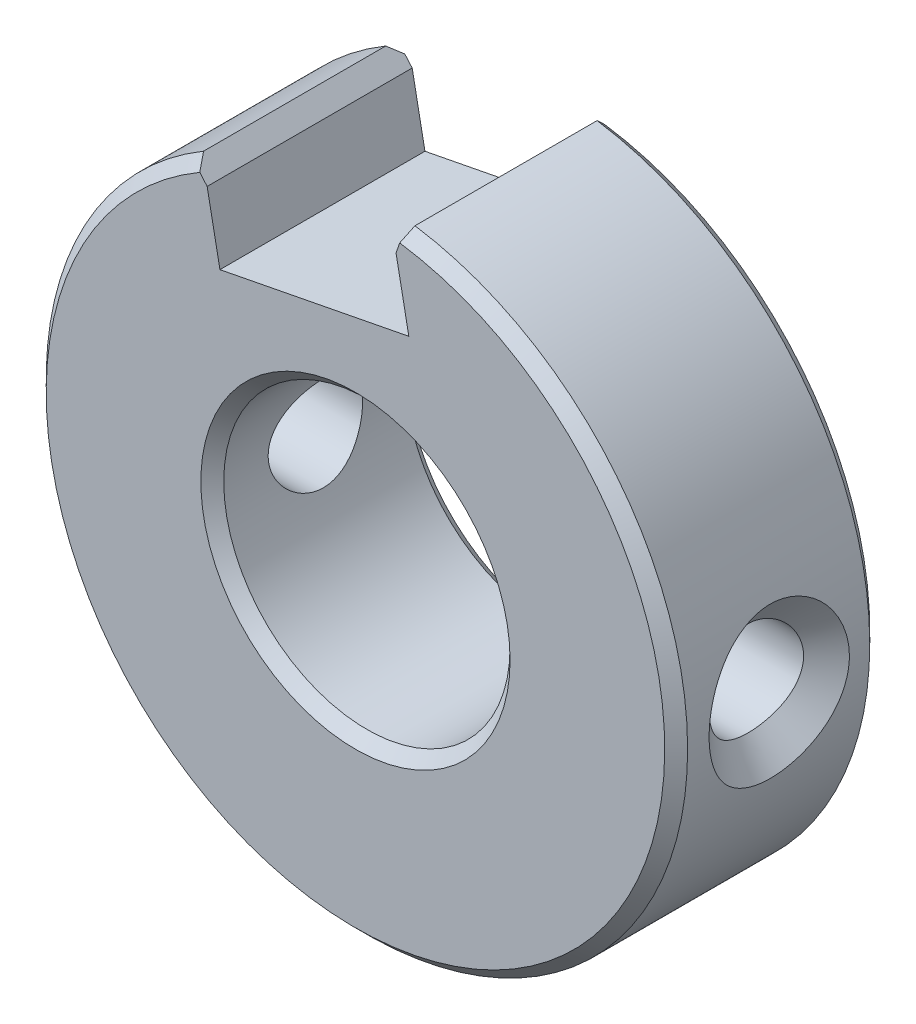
ISO-10303-21;
HEADER;
FILE_DESCRIPTION(('STEP AP214'),'2;1');
FILE_NAME('part.step','',(''),(''),'','','');
FILE_SCHEMA(('AUTOMOTIVE_DESIGN { 1 0 10303 214 1 1 1 1 }'));
ENDSEC;
DATA;
#1=APPLICATION_CONTEXT('core data for automotive mechanical design processes');
#2=APPLICATION_PROTOCOL_DEFINITION('international standard','automotive_design',2000,#1);
#3=PRODUCT_CONTEXT('',#1,'mechanical');
#4=PRODUCT('Part','Part','',(#3));
#5=PRODUCT_RELATED_PRODUCT_CATEGORY('part','',(#4));
#6=PRODUCT_DEFINITION_FORMATION('','',#4);
#7=PRODUCT_DEFINITION_CONTEXT('part definition',#1,'design');
#8=PRODUCT_DEFINITION('design','',#6,#7);
#9=PRODUCT_DEFINITION_SHAPE('','',#8);
#10=(LENGTH_UNIT() NAMED_UNIT(*) SI_UNIT(.MILLI.,.METRE.));
#11=(NAMED_UNIT(*) PLANE_ANGLE_UNIT() SI_UNIT($,.RADIAN.));
#12=(NAMED_UNIT(*) SI_UNIT($,.STERADIAN.) SOLID_ANGLE_UNIT());
#13=UNCERTAINTY_MEASURE_WITH_UNIT(LENGTH_MEASURE(1.E-05),#10,'distance_accuracy_value','');
#14=(GEOMETRIC_REPRESENTATION_CONTEXT(3) GLOBAL_UNCERTAINTY_ASSIGNED_CONTEXT((#13)) GLOBAL_UNIT_ASSIGNED_CONTEXT((#10,
#11,#12)) REPRESENTATION_CONTEXT('',''));
#15=CARTESIAN_POINT('',(0.,0.,0.));
#16=DIRECTION('',(0.,0.,1.));
#17=DIRECTION('',(1.,0.,0.));
#18=AXIS2_PLACEMENT_3D('',#15,#16,#17);
#19=CARTESIAN_POINT('',(0.,0.,17.9));
#20=DIRECTION('',(0.,0.,1.));
#21=DIRECTION('',(1.00000000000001,0.,0.));
#22=AXIS2_PLACEMENT_3D('',#19,#20,#21);
#23=PLANE('',#22);
#24=CARTESIAN_POINT('',(0.,0.,17.9));
#25=DIRECTION('',(0.,0.,1.));
#26=DIRECTION('',(1.00000000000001,0.,0.));
#27=AXIS2_PLACEMENT_3D('',#24,#25,#26);
#28=CIRCLE('',#27,13.5);
#29=CARTESIAN_POINT('',(13.5000000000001,0.,17.9));
#30=VERTEX_POINT('',#29);
#31=EDGE_CURVE('E171',#30,#30,#28,.F.);
#32=ORIENTED_EDGE('',*,*,#31,.T.);
#33=EDGE_LOOP('',(#32));
#34=FACE_BOUND('',#33,.T.);
#35=DIRECTION('',(-0.656059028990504,0.754709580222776,0.));
#36=VECTOR('',#35,1.);
#37=CARTESIAN_POINT('',(-12.9477624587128,22.5873816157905,17.9));
#38=LINE('',#37,#36);
#39=CARTESIAN_POINT('',(-12.9477624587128,22.5873816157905,17.9));
#40=VERTEX_POINT('',#39);
#41=CARTESIAN_POINT('',(-13.5924822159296,23.3290468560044,17.9));
#42=VERTEX_POINT('',#41);
#43=EDGE_CURVE('E144',#40,#42,#38,.T.);
#44=ORIENTED_EDGE('',*,*,#43,.T.);
#45=CARTESIAN_POINT('',(0.,0.,17.9));
#46=DIRECTION('',(0.,0.,1.));
#47=DIRECTION('',(1.00000000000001,0.,0.));
#48=AXIS2_PLACEMENT_3D('',#45,#46,#47);
#49=CIRCLE('',#48,27.);
#50=CARTESIAN_POINT('',(3.86351528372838,26.722149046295,17.9));
#51=VERTEX_POINT('',#50);
#52=EDGE_CURVE('E168',#42,#51,#49,.T.);
#53=ORIENTED_EDGE('',*,*,#52,.T.);
#54=DIRECTION('',(-0.325568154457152,-0.945518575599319,0.));
#55=VECTOR('',#54,1.);
#56=CARTESIAN_POINT('',(3.54357422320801,25.7929727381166,17.9));
#57=LINE('',#56,#55);
#58=CARTESIAN_POINT('',(3.54357422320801,25.7929727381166,17.9));
#59=VERTEX_POINT('',#58);
#60=EDGE_CURVE('E137',#51,#59,#57,.T.);
#61=ORIENTED_EDGE('',*,*,#60,.T.);
#62=DIRECTION('',(0.190808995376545,-0.981627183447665,0.));
#63=VECTOR('',#62,1.);
#64=CARTESIAN_POINT('',(3.54357422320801,25.7929727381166,17.9));
#65=LINE('',#64,#63);
#66=CARTESIAN_POINT('',(4.65845922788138,20.057386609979,17.9));
#67=VERTEX_POINT('',#66);
#68=EDGE_CURVE('E121',#59,#67,#65,.T.);
#69=ORIENTED_EDGE('',*,*,#68,.T.);
#70=DIRECTION('',(-0.981627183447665,-0.190808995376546,0.));
#71=VECTOR('',#70,1.);
#72=CARTESIAN_POINT('',(-11.8328774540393,16.8517954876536,17.9));
#73=LINE('',#72,#71);
#74=CARTESIAN_POINT('',(-11.8328774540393,16.8517954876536,17.9));
#75=VERTEX_POINT('',#74);
#76=EDGE_CURVE('E140',#67,#75,#73,.T.);
#77=ORIENTED_EDGE('',*,*,#76,.T.);
#78=DIRECTION('',(-0.190808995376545,0.981627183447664,0.));
#79=VECTOR('',#78,1.);
#80=CARTESIAN_POINT('',(-12.9477624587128,22.5873816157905,17.9));
#81=LINE('',#80,#79);
#82=EDGE_CURVE('E142',#75,#40,#81,.T.);
#83=ORIENTED_EDGE('',*,*,#82,.T.);
#84=EDGE_LOOP('',(#44,#53,#61,#69,#77,#83));
#85=FACE_BOUND('',#84,.T.);
#86=ADVANCED_FACE('F32',(#34,#85),#23,.T.);
#87=CARTESIAN_POINT('',(0.,0.,0.));
#88=DIRECTION('',(0.,0.,1.));
#89=DIRECTION('',(1.00000000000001,0.,0.));
#90=AXIS2_PLACEMENT_3D('',#87,#88,#89);
#91=PLANE('',#90);
#92=CARTESIAN_POINT('',(0.,0.,0.));
#93=DIRECTION('',(0.,0.,1.));
#94=DIRECTION('',(1.00000000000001,0.,0.));
#95=AXIS2_PLACEMENT_3D('',#92,#93,#94);
#96=CIRCLE('',#95,13.5);
#97=CARTESIAN_POINT('',(13.5000000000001,0.,0.));
#98=VERTEX_POINT('',#97);
#99=EDGE_CURVE('E159',#98,#98,#96,.T.);
#100=ORIENTED_EDGE('',*,*,#99,.T.);
#101=EDGE_LOOP('',(#100));
#102=FACE_BOUND('',#101,.T.);
#103=DIRECTION('',(-0.325568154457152,-0.945518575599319,0.));
#104=VECTOR('',#103,1.);
#105=CARTESIAN_POINT('',(3.54357422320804,25.7929727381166,0.));
#106=LINE('',#105,#104);
#107=CARTESIAN_POINT('',(3.8635152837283,26.7221490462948,0.));
#108=VERTEX_POINT('',#107);
#109=CARTESIAN_POINT('',(3.54357422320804,25.7929727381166,0.));
#110=VERTEX_POINT('',#109);
#111=EDGE_CURVE('E103',#108,#110,#106,.T.);
#112=ORIENTED_EDGE('',*,*,#111,.F.);
#113=CARTESIAN_POINT('',(0.,0.,0.));
#114=DIRECTION('',(0.,0.,1.));
#115=DIRECTION('',(1.00000000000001,0.,0.));
#116=AXIS2_PLACEMENT_3D('',#113,#114,#115);
#117=CIRCLE('',#116,27.);
#118=CARTESIAN_POINT('',(-13.5924822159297,23.3290468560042,0.));
#119=VERTEX_POINT('',#118);
#120=EDGE_CURVE('E157',#108,#119,#117,.F.);
#121=ORIENTED_EDGE('',*,*,#120,.T.);
#122=DIRECTION('',(-0.656059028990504,0.754709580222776,0.));
#123=VECTOR('',#122,1.);
#124=CARTESIAN_POINT('',(-12.9477624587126,22.5873816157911,0.));
#125=LINE('',#124,#123);
#126=CARTESIAN_POINT('',(-12.9477624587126,22.5873816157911,0.));
#127=VERTEX_POINT('',#126);
#128=EDGE_CURVE('E135',#127,#119,#125,.T.);
#129=ORIENTED_EDGE('',*,*,#128,.F.);
#130=DIRECTION('',(-0.190808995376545,0.981627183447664,0.));
#131=VECTOR('',#130,1.);
#132=CARTESIAN_POINT('',(-12.9477624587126,22.5873816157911,0.));
#133=LINE('',#132,#131);
#134=CARTESIAN_POINT('',(-11.8328774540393,16.8517954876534,0.));
#135=VERTEX_POINT('',#134);
#136=EDGE_CURVE('E130',#135,#127,#133,.T.);
#137=ORIENTED_EDGE('',*,*,#136,.F.);
#138=DIRECTION('',(-0.981627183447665,-0.190808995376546,0.));
#139=VECTOR('',#138,1.);
#140=CARTESIAN_POINT('',(-11.8328774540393,16.8517954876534,0.));
#141=LINE('',#140,#139);
#142=CARTESIAN_POINT('',(4.6584592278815,20.0573866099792,0.));
#143=VERTEX_POINT('',#142);
#144=EDGE_CURVE('E128',#143,#135,#141,.T.);
#145=ORIENTED_EDGE('',*,*,#144,.F.);
#146=DIRECTION('',(0.190808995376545,-0.981627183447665,0.));
#147=VECTOR('',#146,1.);
#148=CARTESIAN_POINT('',(3.54357422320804,25.7929727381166,0.));
#149=LINE('',#148,#147);
#150=EDGE_CURVE('E114',#110,#143,#149,.T.);
#151=ORIENTED_EDGE('',*,*,#150,.F.);
#152=EDGE_LOOP('',(#112,#121,#129,#137,#145,#151));
#153=FACE_BOUND('',#152,.T.);
#154=ADVANCED_FACE('F126',(#102,#153),#91,.F.);
#155=CARTESIAN_POINT('',(0.,0.,17.9));
#156=DIRECTION('',(0.,0.,-1.));
#157=DIRECTION('',(-1.00000000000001,0.,0.));
#158=AXIS2_PLACEMENT_3D('',#155,#156,#157);
#159=CYLINDRICAL_SURFACE('',#158,28.);
#160=CARTESIAN_POINT('',(-28.0000000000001,0.,15.0249999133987));
#161=CARTESIAN_POINT('',(-28.0000165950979,0.108450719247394,15.0250790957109));
#162=CARTESIAN_POINT('',(-27.9993237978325,0.21689935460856,15.0225667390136));
#163=CARTESIAN_POINT('',(-27.9965906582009,0.433339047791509,15.0124394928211));
#164=CARTESIAN_POINT('',(-27.994552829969,0.541330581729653,15.0048341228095));
#165=CARTESIAN_POINT('',(-27.9892048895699,0.756628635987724,14.984618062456));
#166=CARTESIAN_POINT('',(-27.9858969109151,0.863935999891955,14.9720157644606));
#167=CARTESIAN_POINT('',(-27.9780842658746,1.07764128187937,14.9419038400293));
#168=CARTESIAN_POINT('',(-27.9735815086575,1.18404037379,14.9244020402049));
#169=CARTESIAN_POINT('',(-27.9634546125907,1.39570390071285,14.8845881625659));
#170=CARTESIAN_POINT('',(-27.957832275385,1.50096987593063,14.8622838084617));
#171=CARTESIAN_POINT('',(-27.9455414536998,1.71014210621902,14.8129615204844));
#172=CARTESIAN_POINT('',(-27.9388747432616,1.81405034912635,14.7859515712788));
#173=CARTESIAN_POINT('',(-27.9245703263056,2.02028189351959,14.7273144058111));
#174=CARTESIAN_POINT('',(-27.9169344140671,2.12260774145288,14.6956957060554));
#175=CARTESIAN_POINT('',(-27.9007667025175,2.32544916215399,14.627937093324));
#176=CARTESIAN_POINT('',(-27.8922367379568,2.42596796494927,14.5918064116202));
#177=CARTESIAN_POINT('',(-27.8743560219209,2.62496982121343,14.5151197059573));
#178=CARTESIAN_POINT('',(-27.8650071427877,2.72345691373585,14.4745737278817));
#179=CARTESIAN_POINT('',(-27.8455636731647,2.91816973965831,14.3891522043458));
#180=CARTESIAN_POINT('',(-27.8354709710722,3.01440043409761,14.3442875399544));
#181=CARTESIAN_POINT('',(-27.8146150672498,3.2043747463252,14.2503243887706));
#182=CARTESIAN_POINT('',(-27.8038537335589,3.2981243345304,14.2012375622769));
#183=CARTESIAN_POINT('',(-27.7817353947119,3.48291058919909,14.0989259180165));
#184=CARTESIAN_POINT('',(-27.7703801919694,3.57395428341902,14.0457134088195));
#185=CARTESIAN_POINT('',(-27.747150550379,3.75310300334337,13.9352462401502));
#186=CARTESIAN_POINT('',(-27.7352777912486,3.84121610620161,13.8780043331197));
#187=CARTESIAN_POINT('',(-27.7110837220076,4.01427737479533,13.7595748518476));
#188=CARTESIAN_POINT('',(-27.698763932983,4.09923458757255,13.6984001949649));
#189=CARTESIAN_POINT('',(-27.6737680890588,4.26575988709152,13.5722003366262));
#190=CARTESIAN_POINT('',(-27.661093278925,4.34733780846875,13.5071878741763));
#191=CARTESIAN_POINT('',(-27.6353996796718,4.50687314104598,13.3734139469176));
#192=CARTESIAN_POINT('',(-27.6223820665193,4.58484090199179,13.3046646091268));
#193=CARTESIAN_POINT('',(-27.5963210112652,4.73690284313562,13.1635422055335));
#194=CARTESIAN_POINT('',(-27.5832778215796,4.81100969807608,13.0911827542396));
#195=CARTESIAN_POINT('',(-27.5574912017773,4.95520932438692,12.9430773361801));
#196=CARTESIAN_POINT('',(-27.5447467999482,5.02531664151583,12.8673456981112));
#197=CARTESIAN_POINT('',(-27.5195764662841,5.16140507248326,12.712713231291));
#198=CARTESIAN_POINT('',(-27.5071495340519,5.22740043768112,12.6338251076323));
#199=CARTESIAN_POINT('',(-27.4827122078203,5.35516001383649,12.4730905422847));
#200=CARTESIAN_POINT('',(-27.4707005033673,5.41693828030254,12.3912554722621));
#201=CARTESIAN_POINT('',(-27.4471705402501,5.53615661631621,12.2248392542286));
#202=CARTESIAN_POINT('',(-27.4356507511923,5.59361064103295,12.140268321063));
#203=CARTESIAN_POINT('',(-27.4131871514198,5.70407387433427,11.9685920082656));
#204=CARTESIAN_POINT('',(-27.4022415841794,5.75709697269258,11.8814957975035));
#205=CARTESIAN_POINT('',(-27.3810074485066,5.8585915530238,11.704980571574));
#206=CARTESIAN_POINT('',(-27.3707169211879,5.90707683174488,11.6155697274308));
#207=CARTESIAN_POINT('',(-27.3508742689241,5.99938903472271,11.4346367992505));
#208=CARTESIAN_POINT('',(-27.3413200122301,6.04322955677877,11.3431218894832));
#209=CARTESIAN_POINT('',(-27.323031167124,6.12614560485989,11.1581924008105));
#210=CARTESIAN_POINT('',(-27.3142943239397,6.16523433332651,11.0647839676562));
#211=CARTESIAN_POINT('',(-27.2977215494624,6.23854035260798,10.8762790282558));
#212=CARTESIAN_POINT('',(-27.2898833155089,6.27277015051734,10.7811875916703));
#213=CARTESIAN_POINT('',(-27.2751889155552,6.33625217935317,10.589528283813));
#214=CARTESIAN_POINT('',(-27.2683305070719,6.36551580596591,10.4929643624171));
#215=CARTESIAN_POINT('',(-27.2556768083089,6.41895976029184,10.2985717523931));
#216=CARTESIAN_POINT('',(-27.2498794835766,6.443149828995,10.2007458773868));
#217=CARTESIAN_POINT('',(-27.2394288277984,6.48634159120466,10.0040410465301));
#218=CARTESIAN_POINT('',(-27.2347738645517,6.50535069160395,9.90516380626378));
#219=CARTESIAN_POINT('',(-27.2266886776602,6.5380757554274,9.70656781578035));
#220=CARTESIAN_POINT('',(-27.2232574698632,6.55179597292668,9.60684980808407));
#221=CARTESIAN_POINT('',(-27.2177000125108,6.57384074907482,9.40678392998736));
#222=CARTESIAN_POINT('',(-27.2155737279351,6.58216545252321,9.3064360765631));
#223=CARTESIAN_POINT('',(-27.2127070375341,6.59331239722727,9.10532104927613));
#224=CARTESIAN_POINT('',(-27.21196790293,6.59612959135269,9.00455357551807));
#225=CARTESIAN_POINT('',(-27.2119522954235,6.59617537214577,8.80302035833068));
#226=CARTESIAN_POINT('',(-27.2126757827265,6.59340411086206,8.70225461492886));
#227=CARTESIAN_POINT('',(-27.2155061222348,6.58237681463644,8.50114429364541));
#228=CARTESIAN_POINT('',(-27.2176116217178,6.57412614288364,8.40079940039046));
#229=CARTESIAN_POINT('',(-27.2231247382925,6.55224643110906,8.20073932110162));
#230=CARTESIAN_POINT('',(-27.226532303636,6.53861760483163,8.1010241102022));
#231=CARTESIAN_POINT('',(-27.2345677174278,6.50609199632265,7.90243205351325));
#232=CARTESIAN_POINT('',(-27.2391964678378,6.48719131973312,7.8035558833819));
#233=CARTESIAN_POINT('',(-27.2495930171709,6.44422999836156,7.60685003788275));
#234=CARTESIAN_POINT('',(-27.2553623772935,6.42016227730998,7.5090219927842));
#235=CARTESIAN_POINT('',(-27.2679591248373,6.36697430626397,7.31462037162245));
#236=CARTESIAN_POINT('',(-27.2747884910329,6.337844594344,7.21804951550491));
#237=CARTESIAN_POINT('',(-27.2894244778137,6.27463919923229,7.02637014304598));
#238=CARTESIAN_POINT('',(-27.2972333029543,6.24055233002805,6.93126548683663));
#239=CARTESIAN_POINT('',(-27.3137476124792,6.16753855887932,6.74272637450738));
#240=CARTESIAN_POINT('',(-27.3224553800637,6.12859927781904,6.64929691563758));
#241=CARTESIAN_POINT('',(-27.3406871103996,6.04598609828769,6.46431608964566));
#242=CARTESIAN_POINT('',(-27.3502133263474,6.00229903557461,6.37277082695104));
#243=CARTESIAN_POINT('',(-27.3700016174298,5.91029531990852,6.19176633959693));
#244=CARTESIAN_POINT('',(-27.3802658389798,5.86196501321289,6.1023142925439));
#245=CARTESIAN_POINT('',(-27.4014497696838,5.76077953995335,5.92570422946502));
#246=CARTESIAN_POINT('',(-27.4123714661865,5.7079104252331,5.8385544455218));
#247=CARTESIAN_POINT('',(-27.4347904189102,5.5977519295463,5.66675695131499));
#248=CARTESIAN_POINT('',(-27.4462894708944,5.54044841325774,5.58211854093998));
#249=CARTESIAN_POINT('',(-27.4697817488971,5.42152542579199,5.41555176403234));
#250=CARTESIAN_POINT('',(-27.4817765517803,5.35989166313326,5.33363382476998));
#251=CARTESIAN_POINT('',(-27.5061845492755,5.23241315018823,5.17271616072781));
#252=CARTESIAN_POINT('',(-27.5185991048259,5.16655392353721,5.09372811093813));
#253=CARTESIAN_POINT('',(-27.543749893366,5.03072691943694,4.93887732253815));
#254=CARTESIAN_POINT('',(-27.5564871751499,4.960744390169,4.86302769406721));
#255=CARTESIAN_POINT('',(-27.5822653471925,4.81678291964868,4.7146642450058));
#256=CARTESIAN_POINT('',(-27.5953072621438,4.74278887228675,4.64216525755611));
#257=CARTESIAN_POINT('',(-27.6213713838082,4.59093910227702,4.50075440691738));
#258=CARTESIAN_POINT('',(-27.6343933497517,4.5130704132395,4.43185642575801));
#259=CARTESIAN_POINT('',(-27.6600999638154,4.35371966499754,4.29779066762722));
#260=CARTESIAN_POINT('',(-27.6727834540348,4.27222724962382,4.23263498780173));
#261=CARTESIAN_POINT('',(-27.697800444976,4.10586156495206,4.10615218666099));
#262=CARTESIAN_POINT('',(-27.7101327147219,4.02097843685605,4.04483779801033));
#263=CARTESIAN_POINT('',(-27.7343551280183,3.84805379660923,3.92613293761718));
#264=CARTESIAN_POINT('',(-27.7462437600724,3.76000319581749,3.86875540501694));
#265=CARTESIAN_POINT('',(-27.7695080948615,3.58096840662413,3.75802097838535));
#266=CARTESIAN_POINT('',(-27.7808821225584,3.48997608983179,3.70467688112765));
#267=CARTESIAN_POINT('',(-27.8030406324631,3.3052818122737,3.60210615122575));
#268=CARTESIAN_POINT('',(-27.8138233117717,3.21157276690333,3.55289189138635));
#269=CARTESIAN_POINT('',(-27.8347239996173,3.02166909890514,3.45867801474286));
#270=CARTESIAN_POINT('',(-27.844840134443,2.92546844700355,3.4136901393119));
#271=CARTESIAN_POINT('',(-27.8643321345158,2.73080558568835,3.32802640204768));
#272=CARTESIAN_POINT('',(-27.8737061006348,2.63233835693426,3.28736151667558));
#273=CARTESIAN_POINT('',(-27.8916382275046,2.43336642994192,3.21044127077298));
#274=CARTESIAN_POINT('',(-27.9001945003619,2.33285763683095,3.17419606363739));
#275=CARTESIAN_POINT('',(-27.9164156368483,2.13002675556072,3.10621274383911));
#276=CARTESIAN_POINT('',(-27.9240786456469,2.02770138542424,3.07448398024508));
#277=CARTESIAN_POINT('',(-27.9384376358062,1.82146163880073,3.01563110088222));
#278=CARTESIAN_POINT('',(-27.9451317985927,1.71754466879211,2.98851562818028));
#279=CARTESIAN_POINT('',(-27.9574774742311,1.50834612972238,2.93898678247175));
#280=CARTESIAN_POINT('',(-27.9631271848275,1.40306253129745,2.91658152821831));
#281=CARTESIAN_POINT('',(-27.9733083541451,1.19135527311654,2.87657040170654));
#282=CARTESIAN_POINT('',(-27.9778379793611,1.0849300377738,2.85897239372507));
#283=CARTESIAN_POINT('',(-27.9857034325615,0.871164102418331,2.82867272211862));
#284=CARTESIAN_POINT('',(-27.9890373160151,0.763822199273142,2.81597903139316));
#285=CARTESIAN_POINT('',(-27.9944358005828,0.548447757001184,2.79558476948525));
#286=CARTESIAN_POINT('',(-27.9964982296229,0.440414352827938,2.78789274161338));
#287=CARTESIAN_POINT('',(-27.9992785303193,0.22388115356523,2.77759744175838));
#288=CARTESIAN_POINT('',(-27.9999938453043,0.115380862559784,2.77500384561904));
#289=CARTESIAN_POINT('',(-28.0000044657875,-0.101658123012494,2.77500299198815));
#290=CARTESIAN_POINT('',(-27.9992992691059,-0.210196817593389,2.77759756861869));
#291=CARTESIAN_POINT('',(-27.9965395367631,-0.426877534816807,2.78789399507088));
#292=CARTESIAN_POINT('',(-27.9944866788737,-0.535019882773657,2.79558949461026));
#293=CARTESIAN_POINT('',(-27.9891076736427,-0.750673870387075,2.81598773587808));
#294=CARTESIAN_POINT('',(-27.9857829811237,-0.858186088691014,2.82868475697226));
#295=CARTESIAN_POINT('',(-27.9779360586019,-1.07234517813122,2.85898742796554));
#296=CARTESIAN_POINT('',(-27.9734152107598,-1.17899290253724,2.87658741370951));
#297=CARTESIAN_POINT('',(-27.9632516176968,-1.39118848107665,2.91659776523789));
#298=CARTESIAN_POINT('',(-27.9576102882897,-1.49673754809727,2.93900206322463));
#299=CARTESIAN_POINT('',(-27.9452812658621,-1.70650113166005,2.98852329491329));
#300=CARTESIAN_POINT('',(-27.9385950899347,-1.81071734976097,3.01563340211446));
#301=CARTESIAN_POINT('',(-27.924251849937,-2.01758041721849,3.07446884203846));
#302=CARTESIAN_POINT('',(-27.9165964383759,-2.12022961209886,3.10618633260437));
#303=CARTESIAN_POINT('',(-27.9003901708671,-2.32372363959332,3.17413938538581));
#304=CARTESIAN_POINT('',(-27.8918411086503,-2.42457162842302,3.21036592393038));
#305=CARTESIAN_POINT('',(-27.8739229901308,-2.62422807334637,3.28724008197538));
#306=CARTESIAN_POINT('',(-27.8645558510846,-2.72304066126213,3.32787741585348));
#307=CARTESIAN_POINT('',(-27.8450770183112,-2.91839095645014,3.41347625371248));
#308=CARTESIAN_POINT('',(-27.834967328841,-3.01493392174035,3.45842621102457));
#309=CARTESIAN_POINT('',(-27.8140789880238,-3.20550948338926,3.55255338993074));
#310=CARTESIAN_POINT('',(-27.8033023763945,-3.29954858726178,3.60171788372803));
#311=CARTESIAN_POINT('',(-27.7811554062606,-3.48488075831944,3.70417713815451));
#312=CARTESIAN_POINT('',(-27.7697870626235,-3.57618166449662,3.75745814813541));
#313=CARTESIAN_POINT('',(-27.746533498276,-3.7558018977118,3.8680533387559));
#314=CARTESIAN_POINT('',(-27.7346501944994,-3.84413041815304,3.92535298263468));
#315=CARTESIAN_POINT('',(-27.7104377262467,-4.01756956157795,4.04388790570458));
#316=CARTESIAN_POINT('',(-27.6981103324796,-4.1026906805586,4.10510817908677));
#317=CARTESIAN_POINT('',(-27.6731027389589,-4.2694815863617,4.23138727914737));
#318=CARTESIAN_POINT('',(-27.6604240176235,-4.35116300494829,4.29643102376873));
#319=CARTESIAN_POINT('',(-27.6347253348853,-4.51083079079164,4.43025674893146));
#320=CARTESIAN_POINT('',(-27.6217068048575,-4.58882967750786,4.4990240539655));
#321=CARTESIAN_POINT('',(-27.595647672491,-4.74089933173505,4.64018023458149));
#322=CARTESIAN_POINT('',(-27.5826073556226,-4.81498426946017,4.71255389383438));
#323=CARTESIAN_POINT('',(-27.5568306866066,-4.959118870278,4.86069023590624));
#324=CARTESIAN_POINT('',(-27.5440933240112,-5.02918354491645,4.93643814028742));
#325=CARTESIAN_POINT('',(-27.5189397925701,-5.16516615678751,5.09110620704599));
#326=CARTESIAN_POINT('',(-27.5065225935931,-5.23109873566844,5.17001332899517));
#327=CARTESIAN_POINT('',(-27.4821073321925,-5.35871598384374,5.33078643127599));
#328=CARTESIAN_POINT('',(-27.4701079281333,-5.42041501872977,5.41264080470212));
#329=CARTESIAN_POINT('',(-27.4466046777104,-5.5394610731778,5.57909449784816));
#330=CARTESIAN_POINT('',(-27.4350992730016,-5.59682229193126,5.66368344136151));
#331=CARTESIAN_POINT('',(-27.4126661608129,-5.70708924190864,5.83539277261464));
#332=CARTESIAN_POINT('',(-27.4017366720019,-5.76000905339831,5.92250388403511));
#333=CARTESIAN_POINT('',(-27.3805359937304,-5.86128946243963,6.09904411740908));
#334=CARTESIAN_POINT('',(-27.3702628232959,-5.90966400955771,6.18846499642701));
#335=CARTESIAN_POINT('',(-27.3504557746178,-6.00175022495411,6.36941141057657));
#336=CARTESIAN_POINT('',(-27.340919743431,-6.04547562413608,6.46092971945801));
#337=CARTESIAN_POINT('',(-27.3226678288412,-6.12815995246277,6.64585765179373));
#338=CARTESIAN_POINT('',(-27.31394966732,-6.16713221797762,6.73926108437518));
#339=CARTESIAN_POINT('',(-27.2974143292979,-6.24020686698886,6.92774590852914));
#340=CARTESIAN_POINT('',(-27.2895948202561,-6.27432191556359,7.0228221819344));
#341=CARTESIAN_POINT('',(-27.2749375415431,-6.33757900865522,7.21443929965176));
#342=CARTESIAN_POINT('',(-27.2680974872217,-6.36673265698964,7.31097613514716));
#343=CARTESIAN_POINT('',(-27.2554797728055,-6.41996419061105,7.50530096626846));
#344=CARTESIAN_POINT('',(-27.2497000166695,-6.44405210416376,7.60308607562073));
#345=CARTESIAN_POINT('',(-27.2392833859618,-6.48705006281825,7.79969402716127));
#346=CARTESIAN_POINT('',(-27.2346447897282,-6.50596791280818,7.89851506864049));
#347=CARTESIAN_POINT('',(-27.2265908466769,-6.53852381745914,8.09698157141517));
#348=CARTESIAN_POINT('',(-27.2231743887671,-6.55216666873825,8.19662619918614));
#349=CARTESIAN_POINT('',(-27.2176445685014,-6.57407324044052,8.39652647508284));
#350=CARTESIAN_POINT('',(-27.2155309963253,-6.58233782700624,8.49678202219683));
#351=CARTESIAN_POINT('',(-27.21268752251,-6.59338277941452,8.69769183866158));
#352=CARTESIAN_POINT('',(-27.2119586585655,-6.59615903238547,8.79834635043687));
#353=CARTESIAN_POINT('',(-27.2119609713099,-6.59614827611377,8.99964819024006));
#354=CARTESIAN_POINT('',(-27.2126920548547,-6.59336162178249,9.10029551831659));
#355=CARTESIAN_POINT('',(-27.2155348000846,-6.58233005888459,9.30117984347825));
#356=CARTESIAN_POINT('',(-27.21764524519,-6.57408996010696,9.40141712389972));
#357=CARTESIAN_POINT('',(-27.2231658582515,-6.55225175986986,9.60127213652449));
#358=CARTESIAN_POINT('',(-27.2265760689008,-6.53865348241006,9.70088984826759));
#359=CARTESIAN_POINT('',(-27.2346147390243,-6.50620468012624,9.89929640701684));
#360=CARTESIAN_POINT('',(-27.2392441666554,-6.48734998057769,9.99808453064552));
#361=CARTESIAN_POINT('',(-27.249640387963,-6.44449133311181,10.194623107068));
#362=CARTESIAN_POINT('',(-27.2554087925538,-6.42048008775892,10.2923718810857));
#363=CARTESIAN_POINT('',(-27.268002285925,-6.3674109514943,10.4866231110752));
#364=CARTESIAN_POINT('',(-27.2748293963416,-6.338343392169,10.5831227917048));
#365=CARTESIAN_POINT('',(-27.2894598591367,-6.27526336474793,10.7746672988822));
#366=CARTESIAN_POINT('',(-27.2972654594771,-6.2412394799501,10.8697081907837));
#367=CARTESIAN_POINT('',(-27.3137726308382,-6.16834796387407,11.0581266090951));
#368=CARTESIAN_POINT('',(-27.3224765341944,-6.12946766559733,11.1514990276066));
#369=CARTESIAN_POINT('',(-27.3407001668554,-6.04696399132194,11.3363719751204));
#370=CARTESIAN_POINT('',(-27.3502222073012,-6.00332707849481,11.4278662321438));
#371=CARTESIAN_POINT('',(-27.3700020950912,-5.91141048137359,11.6087742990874));
#372=CARTESIAN_POINT('',(-27.3802621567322,-5.86311666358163,11.6981806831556));
#373=CARTESIAN_POINT('',(-27.4014380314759,-5.76198629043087,11.8747044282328));
#374=CARTESIAN_POINT('',(-27.4123559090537,-5.70913518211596,11.9618132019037));
#375=CARTESIAN_POINT('',(-27.4347678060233,-5.59899012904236,12.1335331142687));
#376=CARTESIAN_POINT('',(-27.4462637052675,-5.54168130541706,12.2181344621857));
#377=CARTESIAN_POINT('',(-27.4697505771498,-5.42272050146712,12.3846310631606));
#378=CARTESIAN_POINT('',(-27.4817432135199,-5.36105333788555,12.4665152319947));
#379=CARTESIAN_POINT('',(-27.5061481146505,-5.23347601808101,12.6273686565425));
#380=CARTESIAN_POINT('',(-27.5185618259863,-5.16755033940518,12.706325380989));
#381=CARTESIAN_POINT('',(-27.5437124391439,-5.03155430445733,12.8611169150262));
#382=CARTESIAN_POINT('',(-27.5564504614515,-4.96146799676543,12.9369375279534));
#383=CARTESIAN_POINT('',(-27.5822321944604,-4.81725618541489,13.0852438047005));
#384=CARTESIAN_POINT('',(-27.5952770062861,-4.74311421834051,13.1577132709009));
#385=CARTESIAN_POINT('',(-27.6213468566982,-4.59093758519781,13.2990653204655));
#386=CARTESIAN_POINT('',(-27.6343716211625,-4.5128889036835,13.3679328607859));
#387=CARTESIAN_POINT('',(-27.66008193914,-4.35316503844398,13.5019397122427));
#388=CARTESIAN_POINT('',(-27.6727662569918,-4.2714789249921,13.5670662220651));
#389=CARTESIAN_POINT('',(-27.6977835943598,-4.10471482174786,13.6934914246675));
#390=CARTESIAN_POINT('',(-27.710115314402,-4.0196265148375,13.754776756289));
#391=CARTESIAN_POINT('',(-27.734335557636,-3.84628507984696,13.8734257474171));
#392=CARTESIAN_POINT('',(-27.7462225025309,-3.75802252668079,13.9307759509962));
#393=CARTESIAN_POINT('',(-27.769482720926,-3.5785613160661,14.0414586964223));
#394=CARTESIAN_POINT('',(-27.7808542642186,-3.48735430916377,14.0947780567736));
#395=CARTESIAN_POINT('',(-27.8030073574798,-3.3022322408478,14.1973031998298));
#396=CARTESIAN_POINT('',(-27.8137870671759,-3.20830998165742,14.2464963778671));
#397=CARTESIAN_POINT('',(-27.8346816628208,-3.01798554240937,14.3406728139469));
#398=CARTESIAN_POINT('',(-27.8447946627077,-2.92157731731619,14.3856442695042));
#399=CARTESIAN_POINT('',(-27.8642805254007,-2.72650905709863,14.4712807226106));
#400=CARTESIAN_POINT('',(-27.8736515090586,-2.62784407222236,14.5119348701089));
#401=CARTESIAN_POINT('',(-27.8915780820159,-2.42849048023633,14.5888400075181));
#402=CARTESIAN_POINT('',(-27.900131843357,-2.32779791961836,14.6250811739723));
#403=CARTESIAN_POINT('',(-27.9163486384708,-2.12461746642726,14.6930635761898));
#404=CARTESIAN_POINT('',(-27.9240099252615,-2.02212649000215,14.7247960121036));
#405=CARTESIAN_POINT('',(-27.9383664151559,-1.81557761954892,14.7836641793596));
#406=CARTESIAN_POINT('',(-27.945059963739,-1.71151737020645,14.8107920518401));
#407=CARTESIAN_POINT('',(-27.9574056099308,-1.50205852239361,14.8603544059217));
#408=CARTESIAN_POINT('',(-27.9630561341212,-1.39665815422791,14.8827818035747));
#409=CARTESIAN_POINT('',(-27.9732403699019,-1.1847477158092,14.9228466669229));
#410=CARTESIAN_POINT('',(-27.9777725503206,-1.07823632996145,14.9404775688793));
#411=CARTESIAN_POINT('',(-27.9856448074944,-0.864332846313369,14.9708532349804));
#412=CARTESIAN_POINT('',(-27.9889833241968,-0.756939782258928,14.9835916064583));
#413=CARTESIAN_POINT('',(-27.9943929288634,-0.541501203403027,15.0040860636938));
#414=CARTESIAN_POINT('',(-27.9964623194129,-0.433455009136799,15.0118354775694));
#415=CARTESIAN_POINT('',(-27.9992588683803,-0.216941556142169,15.0222574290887));
#416=CARTESIAN_POINT('',(-27.9999840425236,-0.108473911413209,15.0249224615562));
#417=CARTESIAN_POINT('',(-28.0000000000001,0.,15.0249999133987));
#418=B_SPLINE_CURVE_WITH_KNOTS('',3,(#160,#161,#162,#163,#164,#165,#166,#167,#168,#169,#170,
#171,#172,#173,#174,#175,#176,#177,#178,#179,#180,#181,#182,#183,#184,#185,#186,#187,#188,#189,
#190,#191,#192,#193,#194,#195,#196,#197,#198,#199,#200,#201,#202,#203,#204,#205,#206,#207,#208,
#209,#210,#211,#212,#213,#214,#215,#216,#217,#218,#219,#220,#221,#222,#223,#224,#225,#226,#227,
#228,#229,#230,#231,#232,#233,#234,#235,#236,#237,#238,#239,#240,#241,#242,#243,#244,#245,#246,
#247,#248,#249,#250,#251,#252,#253,#254,#255,#256,#257,#258,#259,#260,#261,#262,#263,#264,#265,
#266,#267,#268,#269,#270,#271,#272,#273,#274,#275,#276,#277,#278,#279,#280,#281,#282,#283,#284,
#285,#286,#287,#288,#289,#290,#291,#292,#293,#294,#295,#296,#297,#298,#299,#300,#301,#302,#303,
#304,#305,#306,#307,#308,#309,#310,#311,#312,#313,#314,#315,#316,#317,#318,#319,#320,#321,#322,
#323,#324,#325,#326,#327,#328,#329,#330,#331,#332,#333,#334,#335,#336,#337,#338,#339,#340,#341,
#342,#343,#344,#345,#346,#347,#348,#349,#350,#351,#352,#353,#354,#355,#356,#357,#358,#359,#360,
#361,#362,#363,#364,#365,#366,#367,#368,#369,#370,#371,#372,#373,#374,#375,#376,#377,#378,#379,
#380,#381,#382,#383,#384,#385,#386,#387,#388,#389,#390,#391,#392,#393,#394,#395,#396,#397,#398,
#399,#400,#401,#402,#403,#404,#405,#406,#407,#408,#409,#410,#411,#412,#413,#414,#415,#416,#417),
.UNSPECIFIED.,.F.,.F.,(4,2,2,2,2,2,2,2,2,2,2,2,2,2,2,2,2,2,2,2,2,2,2,2,2,2,2,2,2,2,2,2,2,2,2,2,
2,2,2,2,2,2,2,2,2,2,2,2,2,2,2,2,2,2,2,2,2,2,2,2,2,2,2,2,2,2,2,2,2,2,2,2,2,2,2,2,2,2,2,2,2,2,2,2,
2,2,2,2,2,2,2,2,2,2,2,2,2,2,2,2,2,2,2,2,2,2,2,2,2,2,2,2,2,2,2,2,2,2,2,2,2,2,2,2,2,2,2,2,4),(0.,
0.325313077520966,0.650019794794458,0.974183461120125,1.2978322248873,1.62096431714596,
1.94355335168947,2.26555365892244,2.58690564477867,2.90754117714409,3.22738901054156,
3.54638026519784,3.86445397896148,4.18156274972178,4.49767848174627,4.81279824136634,
5.12695021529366,5.43999582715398,5.75181892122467,6.06249309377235,6.3720753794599,
6.68061144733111,6.98814090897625,7.29470272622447,7.60034070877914,7.90510909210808,
8.20907818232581,8.51234004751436,8.81501422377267,9.11725338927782,9.41924894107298,
9.72123638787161,10.0235004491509,10.3257562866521,10.6277167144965,10.9296651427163,
11.2318372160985,11.5344257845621,11.8375861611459,12.1414415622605,12.4460886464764,
12.7516030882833,13.0580451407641,13.3654651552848,13.6739090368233,13.9834236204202,
14.2940619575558,14.6058885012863,14.9189841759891,15.2332091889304,15.5483985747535,
15.8645827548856,16.181760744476,16.4999061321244,16.8189729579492,17.1389014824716,
17.459623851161,17.7810696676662,18.1031714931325,18.4258702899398,18.7491208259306,
19.0728970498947,19.3971974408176,19.7220503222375,20.0475191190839,20.3731029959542,
20.6982823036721,21.0230907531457,21.3475255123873,21.6715529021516,21.9951141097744,
22.3181309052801,22.6405113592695,22.9621555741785,23.282961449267,23.6028305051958,
23.9216737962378,24.2394179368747,24.5560112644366,24.8714301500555,25.1856854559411,
25.4987116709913,25.8104807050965,26.1210740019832,26.4305551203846,26.7389749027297,
27.046376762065,27.3528020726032,27.6582956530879,27.9629113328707,28.266717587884,
28.5698032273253,28.8722831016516,29.1743037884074,29.4760491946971,29.7777459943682,
30.0796687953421,30.3815723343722,30.6832099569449,30.9848574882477,31.2867452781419,
31.5890631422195,31.8919655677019,32.1955770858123,32.4999977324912,32.805308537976,
33.1115770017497,33.4188625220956,33.7272217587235,34.036713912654,34.3474059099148,
34.6593774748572,34.9727260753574,35.2872931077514,35.6028792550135,35.9195083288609,
36.237171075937,36.5558313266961,36.8754320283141,37.1959011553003,37.5171575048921,
37.8391163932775,38.1616952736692,38.4848192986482,38.808426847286,39.1324750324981,
39.4569451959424,39.7818483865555,40.1072308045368),.UNSPECIFIED.);
#419=CARTESIAN_POINT('',(-28.0000000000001,0.,15.0249999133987));
#420=VERTEX_POINT('',#419);
#421=EDGE_CURVE('E433',#420,#420,#418,.F.);
#422=ORIENTED_EDGE('',*,*,#421,.T.);
#423=EDGE_LOOP('',(#422));
#424=FACE_BOUND('',#423,.T.);
#425=CARTESIAN_POINT('',(28.0000000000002,2.08166817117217E-13,2.77500008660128));
#426=CARTESIAN_POINT('',(28.000016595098,0.108450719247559,2.77492090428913));
#427=CARTESIAN_POINT('',(27.9993237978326,0.216899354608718,2.77743326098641));
#428=CARTESIAN_POINT('',(27.996590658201,0.433339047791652,2.78756050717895));
#429=CARTESIAN_POINT('',(27.9945528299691,0.54133058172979,2.7951658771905));
#430=CARTESIAN_POINT('',(27.98920488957,0.756628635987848,2.815381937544));
#431=CARTESIAN_POINT('',(27.9858969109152,0.863935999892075,2.82798423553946));
#432=CARTESIAN_POINT('',(27.9780842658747,1.07764128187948,2.85809615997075));
#433=CARTESIAN_POINT('',(27.9735815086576,1.1840403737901,2.87559795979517));
#434=CARTESIAN_POINT('',(27.9634546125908,1.39570390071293,2.91541183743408));
#435=CARTESIAN_POINT('',(27.9578322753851,1.5009698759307,2.9377161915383));
#436=CARTESIAN_POINT('',(27.9455414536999,1.71014210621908,2.98703847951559));
#437=CARTESIAN_POINT('',(27.9388747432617,1.81405034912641,3.01404842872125));
#438=CARTESIAN_POINT('',(27.9245703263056,2.02028189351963,3.07268559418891));
#439=CARTESIAN_POINT('',(27.9169344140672,2.12260774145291,3.10430429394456));
#440=CARTESIAN_POINT('',(27.9007667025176,2.32544916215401,3.17206290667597));
#441=CARTESIAN_POINT('',(27.8922367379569,2.42596796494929,3.20819358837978));
#442=CARTESIAN_POINT('',(27.874356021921,2.62496982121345,3.28488029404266));
#443=CARTESIAN_POINT('',(27.8650071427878,2.72345691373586,3.32542627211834));
#444=CARTESIAN_POINT('',(27.8455636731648,2.9181697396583,3.4108477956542));
#445=CARTESIAN_POINT('',(27.8354709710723,3.01440043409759,3.4557124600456));
#446=CARTESIAN_POINT('',(27.8146150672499,3.20437474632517,3.54967561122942));
#447=CARTESIAN_POINT('',(27.8038537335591,3.29812433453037,3.59876243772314));
#448=CARTESIAN_POINT('',(27.781735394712,3.48291058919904,3.7010740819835));
#449=CARTESIAN_POINT('',(27.7703801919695,3.57395428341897,3.75428659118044));
#450=CARTESIAN_POINT('',(27.7471505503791,3.7531030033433,3.86475375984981));
#451=CARTESIAN_POINT('',(27.7352777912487,3.84121610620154,3.92199566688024));
#452=CARTESIAN_POINT('',(27.7110837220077,4.01427737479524,4.04042514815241));
#453=CARTESIAN_POINT('',(27.6987639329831,4.09923458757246,4.10159980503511));
#454=CARTESIAN_POINT('',(27.6737680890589,4.26575988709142,4.22779966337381));
#455=CARTESIAN_POINT('',(27.6610932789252,4.34733780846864,4.29281212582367));
#456=CARTESIAN_POINT('',(27.6353996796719,4.50687314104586,4.42658605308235));
#457=CARTESIAN_POINT('',(27.6223820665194,4.58484090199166,4.49533539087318));
#458=CARTESIAN_POINT('',(27.5963210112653,4.73690284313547,4.63645779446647));
#459=CARTESIAN_POINT('',(27.5832778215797,4.81100969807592,4.70881724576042));
#460=CARTESIAN_POINT('',(27.5574912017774,4.95520932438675,4.8569226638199));
#461=CARTESIAN_POINT('',(27.5447467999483,5.02531664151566,4.93265430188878));
#462=CARTESIAN_POINT('',(27.5195764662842,5.16140507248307,5.08728676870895));
#463=CARTESIAN_POINT('',(27.507149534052,5.22740043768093,5.1661748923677));
#464=CARTESIAN_POINT('',(27.4827122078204,5.35516001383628,5.32690945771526));
#465=CARTESIAN_POINT('',(27.4707005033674,5.41693828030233,5.40874452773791));
#466=CARTESIAN_POINT('',(27.4471705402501,5.53615661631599,5.57516074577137));
#467=CARTESIAN_POINT('',(27.4356507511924,5.59361064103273,5.65973167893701));
#468=CARTESIAN_POINT('',(27.4131871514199,5.70407387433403,5.83140799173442));
#469=CARTESIAN_POINT('',(27.4022415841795,5.75709697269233,5.91850420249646));
#470=CARTESIAN_POINT('',(27.3810074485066,5.85859155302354,6.09501942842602));
#471=CARTESIAN_POINT('',(27.3707169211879,5.90707683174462,6.18443027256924));
#472=CARTESIAN_POINT('',(27.3508742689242,5.99938903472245,6.36536320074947));
#473=CARTESIAN_POINT('',(27.3413200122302,6.0432295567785,6.45687811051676));
#474=CARTESIAN_POINT('',(27.323031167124,6.12614560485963,6.64180759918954));
#475=CARTESIAN_POINT('',(27.3142943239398,6.16523433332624,6.73521603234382));
#476=CARTESIAN_POINT('',(27.2977215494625,6.23854035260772,6.92372097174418));
#477=CARTESIAN_POINT('',(27.289883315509,6.27277015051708,7.01881240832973));
#478=CARTESIAN_POINT('',(27.2751889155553,6.33625217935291,7.21047171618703));
#479=CARTESIAN_POINT('',(27.2683305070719,6.36551580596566,7.3070356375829));
#480=CARTESIAN_POINT('',(27.255676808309,6.41895976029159,7.50142824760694));
#481=CARTESIAN_POINT('',(27.2498794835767,6.44314982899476,7.5992541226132));
#482=CARTESIAN_POINT('',(27.2394288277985,6.48634159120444,7.79595895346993));
#483=CARTESIAN_POINT('',(27.2347738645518,6.50535069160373,7.89483619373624));
#484=CARTESIAN_POINT('',(27.2266886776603,6.5380757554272,8.09343218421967));
#485=CARTESIAN_POINT('',(27.2232574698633,6.55179597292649,8.19315019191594));
#486=CARTESIAN_POINT('',(27.2177000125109,6.57384074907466,8.39321607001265));
#487=CARTESIAN_POINT('',(27.2155737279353,6.58216545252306,8.49356392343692));
#488=CARTESIAN_POINT('',(27.2127070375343,6.59331239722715,8.69467895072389));
#489=CARTESIAN_POINT('',(27.2119679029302,6.59612959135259,8.79544642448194));
#490=CARTESIAN_POINT('',(27.2119522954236,6.5961753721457,8.99697964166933));
#491=CARTESIAN_POINT('',(27.2126757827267,6.59340411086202,9.09774538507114));
#492=CARTESIAN_POINT('',(27.215506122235,6.58237681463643,9.29885570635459));
#493=CARTESIAN_POINT('',(27.217611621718,6.57412614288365,9.39920059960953));
#494=CARTESIAN_POINT('',(27.2231247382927,6.5522464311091,9.59926067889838));
#495=CARTESIAN_POINT('',(27.2265323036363,6.53861760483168,9.69897588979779));
#496=CARTESIAN_POINT('',(27.234567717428,6.50609199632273,9.89756794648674));
#497=CARTESIAN_POINT('',(27.2391964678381,6.48719131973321,9.99644411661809));
#498=CARTESIAN_POINT('',(27.2495930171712,6.44422999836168,10.1931499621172));
#499=CARTESIAN_POINT('',(27.2553623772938,6.4201622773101,10.2909780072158));
#500=CARTESIAN_POINT('',(27.2679591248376,6.36697430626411,10.4853796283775));
#501=CARTESIAN_POINT('',(27.2747884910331,6.33784459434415,10.5819504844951));
#502=CARTESIAN_POINT('',(27.289424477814,6.27463919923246,10.773629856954));
#503=CARTESIAN_POINT('',(27.2972333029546,6.24055233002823,10.8687345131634));
#504=CARTESIAN_POINT('',(27.3137476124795,6.16753855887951,11.0572736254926));
#505=CARTESIAN_POINT('',(27.322455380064,6.12859927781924,11.1507030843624));
#506=CARTESIAN_POINT('',(27.3406871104,6.0459860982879,11.3356839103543));
#507=CARTESIAN_POINT('',(27.3502133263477,6.00229903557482,11.4272291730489));
#508=CARTESIAN_POINT('',(27.3700016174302,5.91029531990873,11.6082336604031));
#509=CARTESIAN_POINT('',(27.3802658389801,5.86196501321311,11.6976857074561));
#510=CARTESIAN_POINT('',(27.4014497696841,5.76077953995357,11.874295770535));
#511=CARTESIAN_POINT('',(27.4123714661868,5.70791042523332,11.9614455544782));
#512=CARTESIAN_POINT('',(27.4347904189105,5.59775192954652,12.133243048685));
#513=CARTESIAN_POINT('',(27.4462894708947,5.54044841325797,12.21788145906));
#514=CARTESIAN_POINT('',(27.4697817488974,5.42152542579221,12.3844482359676));
#515=CARTESIAN_POINT('',(27.4817765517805,5.35989166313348,12.46636617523));
#516=CARTESIAN_POINT('',(27.5061845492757,5.23241315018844,12.6272838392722));
#517=CARTESIAN_POINT('',(27.5185991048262,5.16655392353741,12.7062718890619));
#518=CARTESIAN_POINT('',(27.5437498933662,5.03072691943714,12.8611226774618));
#519=CARTESIAN_POINT('',(27.5564871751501,4.9607443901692,12.9369723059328));
#520=CARTESIAN_POINT('',(27.5822653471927,4.81678291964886,13.0853357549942));
#521=CARTESIAN_POINT('',(27.5953072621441,4.74278887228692,13.1578347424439));
#522=CARTESIAN_POINT('',(27.6213713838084,4.59093910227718,13.2992455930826));
#523=CARTESIAN_POINT('',(27.6343933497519,4.51307041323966,13.368143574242));
#524=CARTESIAN_POINT('',(27.6600999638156,4.35371966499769,13.5022093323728));
#525=CARTESIAN_POINT('',(27.672783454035,4.27222724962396,13.5673650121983));
#526=CARTESIAN_POINT('',(27.6978004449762,4.10586156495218,13.693847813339));
#527=CARTESIAN_POINT('',(27.7101327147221,4.02097843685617,13.7551622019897));
#528=CARTESIAN_POINT('',(27.7343551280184,3.84805379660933,13.8738670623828));
#529=CARTESIAN_POINT('',(27.7462437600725,3.76000319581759,13.931244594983));
#530=CARTESIAN_POINT('',(27.7695080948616,3.58096840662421,14.0419790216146));
#531=CARTESIAN_POINT('',(27.7808821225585,3.48997608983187,14.0953231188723));
#532=CARTESIAN_POINT('',(27.8030406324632,3.30528181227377,14.1978938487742));
#533=CARTESIAN_POINT('',(27.8138233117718,3.2115727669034,14.2471081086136));
#534=CARTESIAN_POINT('',(27.8347239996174,3.0216690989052,14.3413219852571));
#535=CARTESIAN_POINT('',(27.8448401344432,2.9254684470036,14.3863098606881));
#536=CARTESIAN_POINT('',(27.8643321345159,2.73080558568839,14.4719735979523));
#537=CARTESIAN_POINT('',(27.8737061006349,2.63233835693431,14.5126384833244));
#538=CARTESIAN_POINT('',(27.8916382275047,2.43336642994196,14.589558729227));
#539=CARTESIAN_POINT('',(27.9001945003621,2.33285763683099,14.6258039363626));
#540=CARTESIAN_POINT('',(27.9164156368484,2.13002675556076,14.6937872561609));
#541=CARTESIAN_POINT('',(27.9240786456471,2.02770138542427,14.7255160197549));
#542=CARTESIAN_POINT('',(27.9384376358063,1.82146163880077,14.7843688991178));
#543=CARTESIAN_POINT('',(27.9451317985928,1.71754466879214,14.8114843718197));
#544=CARTESIAN_POINT('',(27.9574774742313,1.50834612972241,14.8610132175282));
#545=CARTESIAN_POINT('',(27.9631271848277,1.40306253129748,14.8834184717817));
#546=CARTESIAN_POINT('',(27.9733083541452,1.19135527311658,14.9234295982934));
#547=CARTESIAN_POINT('',(27.9778379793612,1.08493003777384,14.9410276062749));
#548=CARTESIAN_POINT('',(27.9857034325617,0.871164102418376,14.9713272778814));
#549=CARTESIAN_POINT('',(27.9890373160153,0.76382219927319,14.9840209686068));
#550=CARTESIAN_POINT('',(27.994435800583,0.54844775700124,15.0044152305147));
#551=CARTESIAN_POINT('',(27.9964982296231,0.440414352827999,15.0121072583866));
#552=CARTESIAN_POINT('',(27.9992785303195,0.223881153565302,15.0224025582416));
#553=CARTESIAN_POINT('',(27.9999938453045,0.115380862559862,15.0249961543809));
#554=CARTESIAN_POINT('',(28.0000044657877,-0.101658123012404,15.0249970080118));
#555=CARTESIAN_POINT('',(27.9992992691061,-0.210196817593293,15.0224024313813));
#556=CARTESIAN_POINT('',(27.9965395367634,-0.4268775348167,15.0121060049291));
#557=CARTESIAN_POINT('',(27.9944866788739,-0.535019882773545,15.0044105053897));
#558=CARTESIAN_POINT('',(27.989107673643,-0.750673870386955,14.9840122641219));
#559=CARTESIAN_POINT('',(27.9857829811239,-0.85818608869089,14.9713152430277));
#560=CARTESIAN_POINT('',(27.9779360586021,-1.07234517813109,14.9410125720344));
#561=CARTESIAN_POINT('',(27.97341521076,-1.17899290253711,14.9234125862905));
#562=CARTESIAN_POINT('',(27.963251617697,-1.39118848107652,14.8834022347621));
#563=CARTESIAN_POINT('',(27.9576102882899,-1.49673754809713,14.8609979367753));
#564=CARTESIAN_POINT('',(27.9452812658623,-1.70650113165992,14.8114767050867));
#565=CARTESIAN_POINT('',(27.9385950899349,-1.81071734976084,14.7843665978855));
#566=CARTESIAN_POINT('',(27.9242518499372,-2.01758041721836,14.7255311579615));
#567=CARTESIAN_POINT('',(27.9165964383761,-2.12022961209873,14.6938136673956));
#568=CARTESIAN_POINT('',(27.9003901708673,-2.32372363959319,14.6258606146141));
#569=CARTESIAN_POINT('',(27.8918411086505,-2.42457162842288,14.5896340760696));
#570=CARTESIAN_POINT('',(27.8739229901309,-2.62422807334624,14.5127599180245));
#571=CARTESIAN_POINT('',(27.8645558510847,-2.723040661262,14.4721225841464));
#572=CARTESIAN_POINT('',(27.8450770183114,-2.91839095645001,14.3865237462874));
#573=CARTESIAN_POINT('',(27.8349673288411,-3.01493392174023,14.3415737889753));
#574=CARTESIAN_POINT('',(27.8140789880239,-3.20550948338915,14.2474466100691));
#575=CARTESIAN_POINT('',(27.8033023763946,-3.29954858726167,14.1982821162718));
#576=CARTESIAN_POINT('',(27.7811554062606,-3.48488075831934,14.0958228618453));
#577=CARTESIAN_POINT('',(27.7697870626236,-3.57618166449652,14.0425418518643));
#578=CARTESIAN_POINT('',(27.7465334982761,-3.75580189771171,13.9319466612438));
#579=CARTESIAN_POINT('',(27.7346501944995,-3.84413041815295,13.874647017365));
#580=CARTESIAN_POINT('',(27.7104377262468,-4.01756956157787,13.7561120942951));
#581=CARTESIAN_POINT('',(27.6981103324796,-4.10269068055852,13.6948918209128));
#582=CARTESIAN_POINT('',(27.6731027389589,-4.26948158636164,13.5686127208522));
#583=CARTESIAN_POINT('',(27.6604240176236,-4.35116300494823,13.5035689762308));
#584=CARTESIAN_POINT('',(27.6347253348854,-4.51083079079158,13.369743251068));
#585=CARTESIAN_POINT('',(27.6217068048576,-4.5888296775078,13.3009759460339));
#586=CARTESIAN_POINT('',(27.595647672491,-4.740899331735,13.1598197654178));
#587=CARTESIAN_POINT('',(27.5826073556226,-4.81498426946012,13.0874461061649));
#588=CARTESIAN_POINT('',(27.5568306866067,-4.95911887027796,12.939309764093));
#589=CARTESIAN_POINT('',(27.5440933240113,-5.02918354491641,12.8635618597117));
#590=CARTESIAN_POINT('',(27.5189397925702,-5.16516615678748,12.7088937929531));
#591=CARTESIAN_POINT('',(27.5065225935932,-5.23109873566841,12.6299866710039));
#592=CARTESIAN_POINT('',(27.4821073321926,-5.35871598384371,12.469213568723));
#593=CARTESIAN_POINT('',(27.4701079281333,-5.42041501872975,12.3873591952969));
#594=CARTESIAN_POINT('',(27.4466046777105,-5.53946107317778,12.2209055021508));
#595=CARTESIAN_POINT('',(27.4350992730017,-5.59682229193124,12.1363165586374));
#596=CARTESIAN_POINT('',(27.412666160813,-5.70708924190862,11.9646072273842));
#597=CARTESIAN_POINT('',(27.401736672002,-5.76000905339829,11.8774961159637));
#598=CARTESIAN_POINT('',(27.3805359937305,-5.86128946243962,11.7009558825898));
#599=CARTESIAN_POINT('',(27.370262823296,-5.9096640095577,11.6115350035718));
#600=CARTESIAN_POINT('',(27.3504557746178,-6.0017502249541,11.4305885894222));
#601=CARTESIAN_POINT('',(27.3409197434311,-6.04547562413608,11.3390702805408));
#602=CARTESIAN_POINT('',(27.3226678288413,-6.12815995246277,11.154142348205));
#603=CARTESIAN_POINT('',(27.3139496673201,-6.16713221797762,11.0607389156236));
#604=CARTESIAN_POINT('',(27.297414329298,-6.24020686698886,10.8722540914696));
#605=CARTESIAN_POINT('',(27.2895948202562,-6.2743219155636,10.7771778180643));
#606=CARTESIAN_POINT('',(27.2749375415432,-6.33757900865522,10.585560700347));
#607=CARTESIAN_POINT('',(27.2680974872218,-6.36673265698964,10.4890238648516));
#608=CARTESIAN_POINT('',(27.2554797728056,-6.41996419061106,10.2946990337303));
#609=CARTESIAN_POINT('',(27.2497000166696,-6.44405210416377,10.196913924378));
#610=CARTESIAN_POINT('',(27.2392833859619,-6.48705006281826,10.0003059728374));
#611=CARTESIAN_POINT('',(27.2346447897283,-6.50596791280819,9.90148493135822));
#612=CARTESIAN_POINT('',(27.226590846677,-6.53852381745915,9.70301842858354));
#613=CARTESIAN_POINT('',(27.2231743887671,-6.55216666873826,9.60337380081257));
#614=CARTESIAN_POINT('',(27.2176445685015,-6.57407324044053,9.40347352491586));
#615=CARTESIAN_POINT('',(27.2155309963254,-6.58233782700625,9.30321797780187));
#616=CARTESIAN_POINT('',(27.2126875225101,-6.59338277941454,9.10230816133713));
#617=CARTESIAN_POINT('',(27.2119586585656,-6.59615903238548,9.00165364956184));
#618=CARTESIAN_POINT('',(27.21196097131,-6.59614827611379,8.80035180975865));
#619=CARTESIAN_POINT('',(27.2126920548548,-6.59336162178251,8.69970448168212));
#620=CARTESIAN_POINT('',(27.2155348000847,-6.58233005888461,8.49882015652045));
#621=CARTESIAN_POINT('',(27.2176452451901,-6.57408996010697,8.39858287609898));
#622=CARTESIAN_POINT('',(27.2231658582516,-6.55225175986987,8.19872786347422));
#623=CARTESIAN_POINT('',(27.226576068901,-6.53865348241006,8.09911015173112));
#624=CARTESIAN_POINT('',(27.2346147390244,-6.50620468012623,7.90070359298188));
#625=CARTESIAN_POINT('',(27.2392441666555,-6.48734998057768,7.80191546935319));
#626=CARTESIAN_POINT('',(27.2496403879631,-6.44449133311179,7.60537689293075));
#627=CARTESIAN_POINT('',(27.255408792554,-6.42048008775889,7.50762811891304));
#628=CARTESIAN_POINT('',(27.2680022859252,-6.36741095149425,7.31337688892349));
#629=CARTESIAN_POINT('',(27.2748293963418,-6.33834339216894,7.21687720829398));
#630=CARTESIAN_POINT('',(27.2894598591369,-6.27526336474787,7.0253327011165));
#631=CARTESIAN_POINT('',(27.2972654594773,-6.24123947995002,6.93029180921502));
#632=CARTESIAN_POINT('',(27.3137726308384,-6.16834796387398,6.74187339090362));
#633=CARTESIAN_POINT('',(27.3224765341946,-6.12946766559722,6.64850097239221));
#634=CARTESIAN_POINT('',(27.3407001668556,-6.04696399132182,6.46362802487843));
#635=CARTESIAN_POINT('',(27.3502222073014,-6.00332707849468,6.37213376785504));
#636=CARTESIAN_POINT('',(27.3700020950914,-5.91141048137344,6.19122570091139));
#637=CARTESIAN_POINT('',(27.3802621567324,-5.86311666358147,6.10181931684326));
#638=CARTESIAN_POINT('',(27.4014380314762,-5.76198629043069,5.92529557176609));
#639=CARTESIAN_POINT('',(27.4123559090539,-5.70913518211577,5.83818679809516));
#640=CARTESIAN_POINT('',(27.4347678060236,-5.59899012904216,5.66646688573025));
#641=CARTESIAN_POINT('',(27.4462637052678,-5.54168130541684,5.58186553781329));
#642=CARTESIAN_POINT('',(27.4697505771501,-5.42272050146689,5.41536893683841));
#643=CARTESIAN_POINT('',(27.4817432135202,-5.36105333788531,5.33348476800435));
#644=CARTESIAN_POINT('',(27.5061481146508,-5.23347601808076,5.17263134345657));
#645=CARTESIAN_POINT('',(27.5185618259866,-5.16755033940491,5.09367461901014));
#646=CARTESIAN_POINT('',(27.5437124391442,-5.03155430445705,4.93888308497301));
#647=CARTESIAN_POINT('',(27.5564504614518,-4.96146799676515,4.86306247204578));
#648=CARTESIAN_POINT('',(27.5822321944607,-4.8172561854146,4.71475619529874));
#649=CARTESIAN_POINT('',(27.5952770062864,-4.74311421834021,4.64228672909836));
#650=CARTESIAN_POINT('',(27.6213468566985,-4.59093758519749,4.50093467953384));
#651=CARTESIAN_POINT('',(27.6343716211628,-4.51288890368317,4.43206713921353));
#652=CARTESIAN_POINT('',(27.6600819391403,-4.35316503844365,4.29806028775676));
#653=CARTESIAN_POINT('',(27.6727662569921,-4.27147892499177,4.23293377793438));
#654=CARTESIAN_POINT('',(27.6977835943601,-4.10471482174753,4.10650857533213));
#655=CARTESIAN_POINT('',(27.7101153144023,-4.01962651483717,4.04522324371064));
#656=CARTESIAN_POINT('',(27.7343355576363,-3.84628507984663,3.92657425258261));
#657=CARTESIAN_POINT('',(27.7462225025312,-3.75802252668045,3.86922404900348));
#658=CARTESIAN_POINT('',(27.7694827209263,-3.57856131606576,3.75854130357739));
#659=CARTESIAN_POINT('',(27.7808542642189,-3.48735430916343,3.7052219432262));
#660=CARTESIAN_POINT('',(27.8030073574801,-3.30223224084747,3.60269680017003));
#661=CARTESIAN_POINT('',(27.8137870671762,-3.20830998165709,3.55350362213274));
#662=CARTESIAN_POINT('',(27.8346816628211,-3.01798554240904,3.45932718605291));
#663=CARTESIAN_POINT('',(27.8447946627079,-2.92157731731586,3.41435573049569));
#664=CARTESIAN_POINT('',(27.864280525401,-2.72650905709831,3.32871927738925));
#665=CARTESIAN_POINT('',(27.8736515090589,-2.62784407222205,3.288065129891));
#666=CARTESIAN_POINT('',(27.8915780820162,-2.42849048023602,3.21115999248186));
#667=CARTESIAN_POINT('',(27.9001318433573,-2.32779791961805,3.17491882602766));
#668=CARTESIAN_POINT('',(27.916348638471,-2.12461746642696,3.10693642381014));
#669=CARTESIAN_POINT('',(27.9240099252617,-2.02212649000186,3.07520398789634));
#670=CARTESIAN_POINT('',(27.9383664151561,-1.81557761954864,3.01633582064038));
#671=CARTESIAN_POINT('',(27.9450599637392,-1.71151737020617,2.98920794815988));
#672=CARTESIAN_POINT('',(27.957405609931,-1.50205852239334,2.9396455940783));
#673=CARTESIAN_POINT('',(27.9630561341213,-1.39665815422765,2.91721819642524));
#674=CARTESIAN_POINT('',(27.9732403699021,-1.18474771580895,2.87715333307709));
#675=CARTESIAN_POINT('',(27.9777725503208,-1.07823632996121,2.85952243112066));
#676=CARTESIAN_POINT('',(27.9856448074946,-0.86433284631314,2.8291467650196));
#677=CARTESIAN_POINT('',(27.988983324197,-0.756939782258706,2.81640839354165));
#678=CARTESIAN_POINT('',(27.9943929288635,-0.541501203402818,2.79591393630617));
#679=CARTESIAN_POINT('',(27.9964623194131,-0.433455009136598,2.7881645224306));
#680=CARTESIAN_POINT('',(27.9992588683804,-0.216941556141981,2.77774257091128));
#681=CARTESIAN_POINT('',(27.9999840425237,-0.108473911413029,2.77507753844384));
#682=CARTESIAN_POINT('',(28.0000000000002,2.08166817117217E-13,2.77500008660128));
#683=B_SPLINE_CURVE_WITH_KNOTS('',3,(#425,#426,#427,#428,#429,#430,#431,#432,#433,#434,#435,
#436,#437,#438,#439,#440,#441,#442,#443,#444,#445,#446,#447,#448,#449,#450,#451,#452,#453,#454,
#455,#456,#457,#458,#459,#460,#461,#462,#463,#464,#465,#466,#467,#468,#469,#470,#471,#472,#473,
#474,#475,#476,#477,#478,#479,#480,#481,#482,#483,#484,#485,#486,#487,#488,#489,#490,#491,#492,
#493,#494,#495,#496,#497,#498,#499,#500,#501,#502,#503,#504,#505,#506,#507,#508,#509,#510,#511,
#512,#513,#514,#515,#516,#517,#518,#519,#520,#521,#522,#523,#524,#525,#526,#527,#528,#529,#530,
#531,#532,#533,#534,#535,#536,#537,#538,#539,#540,#541,#542,#543,#544,#545,#546,#547,#548,#549,
#550,#551,#552,#553,#554,#555,#556,#557,#558,#559,#560,#561,#562,#563,#564,#565,#566,#567,#568,
#569,#570,#571,#572,#573,#574,#575,#576,#577,#578,#579,#580,#581,#582,#583,#584,#585,#586,#587,
#588,#589,#590,#591,#592,#593,#594,#595,#596,#597,#598,#599,#600,#601,#602,#603,#604,#605,#606,
#607,#608,#609,#610,#611,#612,#613,#614,#615,#616,#617,#618,#619,#620,#621,#622,#623,#624,#625,
#626,#627,#628,#629,#630,#631,#632,#633,#634,#635,#636,#637,#638,#639,#640,#641,#642,#643,#644,
#645,#646,#647,#648,#649,#650,#651,#652,#653,#654,#655,#656,#657,#658,#659,#660,#661,#662,#663,
#664,#665,#666,#667,#668,#669,#670,#671,#672,#673,#674,#675,#676,#677,#678,#679,#680,#681,#682),
.UNSPECIFIED.,.F.,.F.,(4,2,2,2,2,2,2,2,2,2,2,2,2,2,2,2,2,2,2,2,2,2,2,2,2,2,2,2,2,2,2,2,2,2,2,2,
2,2,2,2,2,2,2,2,2,2,2,2,2,2,2,2,2,2,2,2,2,2,2,2,2,2,2,2,2,2,2,2,2,2,2,2,2,2,2,2,2,2,2,2,2,2,2,2,
2,2,2,2,2,2,2,2,2,2,2,2,2,2,2,2,2,2,2,2,2,2,2,2,2,2,2,2,2,2,2,2,2,2,2,2,2,2,2,2,2,2,2,2,4),(0.,
0.325313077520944,0.650019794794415,0.974183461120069,1.29783222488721,1.62096431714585,
1.94355335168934,2.2655536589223,2.58690564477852,2.90754117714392,3.22738901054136,
3.54638026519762,3.86445397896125,4.18156274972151,4.497678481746,4.81279824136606,
5.12695021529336,5.43999582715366,5.75181892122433,6.06249309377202,6.37207537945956,
6.68061144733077,6.98814090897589,7.29470272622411,7.60034070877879,7.90510909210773,
8.20907818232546,8.51234004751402,8.81501422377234,9.11725338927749,9.41924894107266,
9.72123638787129,10.0235004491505,10.3257562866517,10.6277167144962,10.9296651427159,
11.2318372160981,11.5344257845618,11.8375861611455,12.1414415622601,12.446088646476,
12.7516030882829,13.0580451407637,13.3654651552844,13.6739090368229,13.9834236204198,
14.2940619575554,14.605888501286,14.9189841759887,15.23320918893,15.5483985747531,
15.8645827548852,16.1817607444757,16.499906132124,16.8189729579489,17.1389014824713,
17.4596238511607,17.7810696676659,18.1031714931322,18.4258702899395,18.7491208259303,
19.0728970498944,19.3971974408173,19.7220503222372,20.0475191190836,20.3731029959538,
20.6982823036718,21.0230907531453,21.3475255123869,21.6715529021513,21.9951141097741,
22.3181309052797,22.6405113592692,22.9621555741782,23.2829614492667,23.6028305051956,
23.9216737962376,24.2394179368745,24.5560112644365,24.8714301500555,25.1856854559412,
25.4987116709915,25.8104807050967,26.1210740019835,26.4305551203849,26.7389749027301,
27.0463767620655,27.3528020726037,27.6582956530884,27.9629113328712,28.2667175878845,
28.5698032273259,28.8722831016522,29.174303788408,29.4760491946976,29.7777459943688,
30.0796687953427,30.3815723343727,30.6832099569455,30.9848574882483,31.2867452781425,
31.5890631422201,31.8919655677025,32.1955770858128,32.4999977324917,32.8053085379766,
33.1115770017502,33.418862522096,33.727221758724,34.0367139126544,34.3474059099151,
34.6593774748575,34.9727260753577,35.2872931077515,35.6028792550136,35.919508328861,
36.237171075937,36.5558313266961,36.8754320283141,37.1959011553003,37.517157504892,
37.8391163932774,38.1616952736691,38.4848192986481,38.8084268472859,39.132475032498,
39.4569451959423,39.7818483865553,40.1072308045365),.UNSPECIFIED.);
#684=CARTESIAN_POINT('',(28.0000000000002,2.08166817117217E-13,2.77500008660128));
#685=VERTEX_POINT('',#684);
#686=EDGE_CURVE('E219',#685,#685,#683,.F.);
#687=ORIENTED_EDGE('',*,*,#686,.T.);
#688=EDGE_LOOP('',(#687));
#689=FACE_BOUND('',#688,.T.);
#690=DIRECTION('',(0.,0.,-1.));
#691=VECTOR('',#690,1.);
#692=CARTESIAN_POINT('',(4.19471053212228,27.684009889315,17.9));
#693=LINE('',#692,#691);
#694=CARTESIAN_POINT('',(4.19471053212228,27.684009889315,16.9));
#695=VERTEX_POINT('',#694);
#696=CARTESIAN_POINT('',(4.1947105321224,27.6840098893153,1.));
#697=VERTEX_POINT('',#696);
#698=EDGE_CURVE('E122',#695,#697,#693,.T.);
#699=ORIENTED_EDGE('',*,*,#698,.F.);
#700=CARTESIAN_POINT('',(0.,0.,16.9));
#701=DIRECTION('',(0.,0.,1.));
#702=DIRECTION('',(1.00000000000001,0.,0.));
#703=AXIS2_PLACEMENT_3D('',#700,#701,#702);
#704=CIRCLE('',#703,28.);
#705=CARTESIAN_POINT('',(-14.2598805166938,24.0968007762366,16.9));
#706=VERTEX_POINT('',#705);
#707=EDGE_CURVE('E58',#695,#706,#704,.F.);
#708=ORIENTED_EDGE('',*,*,#707,.T.);
#709=DIRECTION('',(0.,0.,-1.));
#710=VECTOR('',#709,1.);
#711=CARTESIAN_POINT('',(-14.2598805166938,24.0968007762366,17.9));
#712=LINE('',#711,#710);
#713=CARTESIAN_POINT('',(-14.2598805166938,24.0968007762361,1.));
#714=VERTEX_POINT('',#713);
#715=EDGE_CURVE('E147',#706,#714,#712,.T.);
#716=ORIENTED_EDGE('',*,*,#715,.T.);
#717=CARTESIAN_POINT('',(1.04083408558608E-13,1.11022302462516E-13,1.));
#718=DIRECTION('',(0.,0.,1.));
#719=DIRECTION('',(1.00000000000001,0.,0.));
#720=AXIS2_PLACEMENT_3D('',#717,#718,#719);
#721=CIRCLE('',#720,28.);
#722=EDGE_CURVE('E322',#714,#697,#721,.T.);
#723=ORIENTED_EDGE('',*,*,#722,.T.);
#724=EDGE_LOOP('',(#699,#708,#716,#723));
#725=FACE_BOUND('',#724,.T.);
#726=ADVANCED_FACE('F34',(#424,#689,#725),#159,.T.);
#727=CARTESIAN_POINT('',(3.54357422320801,25.7929727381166,17.9));
#728=DIRECTION('',(0.945518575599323,-0.325568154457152,0.));
#729=DIRECTION('',(0.325568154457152,0.94551857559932,0.));
#730=AXIS2_PLACEMENT_3D('',#727,#728,#729);
#731=PLANE('',#730);
#732=ORIENTED_EDGE('',*,*,#60,.F.);
#733=CARTESIAN_POINT('',(3.86351528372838,26.722149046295,17.9));
#734=CARTESIAN_POINT('',(3.9187316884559,26.8825091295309,17.73338706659));
#735=CARTESIAN_POINT('',(3.97393949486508,27.042844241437,17.5667472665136));
#736=CARTESIAN_POINT('',(4.08433791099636,27.3634645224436,17.2334139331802));
#737=CARTESIAN_POINT('',(4.13952852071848,27.5237496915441,17.0667203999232));
#738=CARTESIAN_POINT('',(4.19471053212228,27.684009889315,16.9));
#739=B_SPLINE_CURVE_WITH_KNOTS('',3,(#733,#734,#735,#736,#737,#738),.UNSPECIFIED.,.F.,.F.,(4,2,
4),(0.,0.713243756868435,1.42648751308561),.UNSPECIFIED.);
#740=EDGE_CURVE('E179',#51,#695,#739,.T.);
#741=ORIENTED_EDGE('',*,*,#740,.T.);
#742=ORIENTED_EDGE('',*,*,#698,.T.);
#743=CARTESIAN_POINT('',(4.1947105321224,27.6840098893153,1.));
#744=CARTESIAN_POINT('',(4.13952852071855,27.5237496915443,0.833279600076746));
#745=CARTESIAN_POINT('',(4.08433791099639,27.3634645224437,0.666586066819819));
#746=CARTESIAN_POINT('',(3.97393949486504,27.0428442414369,0.333252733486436));
#747=CARTESIAN_POINT('',(3.91873168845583,26.8825091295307,0.16661293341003));
#748=CARTESIAN_POINT('',(3.8635152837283,26.7221490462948,0.));
#749=B_SPLINE_CURVE_WITH_KNOTS('',3,(#743,#744,#745,#746,#747,#748),.UNSPECIFIED.,.F.,.F.,(4,2,
4),(0.,0.713243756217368,1.42648751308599),.UNSPECIFIED.);
#750=EDGE_CURVE('E110',#697,#108,#749,.T.);
#751=ORIENTED_EDGE('',*,*,#750,.T.);
#752=ORIENTED_EDGE('',*,*,#111,.T.);
#753=DIRECTION('',(0.,0.,-1.));
#754=VECTOR('',#753,1.);
#755=CARTESIAN_POINT('',(3.54357422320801,25.7929727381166,17.9));
#756=LINE('',#755,#754);
#757=EDGE_CURVE('E107',#59,#110,#756,.T.);
#758=ORIENTED_EDGE('',*,*,#757,.F.);
#759=EDGE_LOOP('',(#732,#741,#742,#751,#752,#758));
#760=FACE_BOUND('',#759,.T.);
#761=ADVANCED_FACE('F106',(#760),#731,.F.);
#762=CARTESIAN_POINT('',(3.54357422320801,25.7929727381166,17.9));
#763=DIRECTION('',(0.981627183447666,0.190808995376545,0.));
#764=DIRECTION('',(-0.190808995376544,0.981627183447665,0.));
#765=AXIS2_PLACEMENT_3D('',#762,#763,#764);
#766=PLANE('',#765);
#767=ORIENTED_EDGE('',*,*,#150,.T.);
#768=DIRECTION('',(0.,0.,-1.));
#769=VECTOR('',#768,1.);
#770=CARTESIAN_POINT('',(4.65845922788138,20.057386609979,17.9));
#771=LINE('',#770,#769);
#772=EDGE_CURVE('E123',#67,#143,#771,.T.);
#773=ORIENTED_EDGE('',*,*,#772,.F.);
#774=ORIENTED_EDGE('',*,*,#68,.F.);
#775=ORIENTED_EDGE('',*,*,#757,.T.);
#776=EDGE_LOOP('',(#767,#773,#774,#775));
#777=FACE_BOUND('',#776,.T.);
#778=ADVANCED_FACE('F118',(#777),#766,.F.);
#779=CARTESIAN_POINT('',(-11.8328774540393,16.8517954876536,17.9));
#780=DIRECTION('',(0.190808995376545,-0.981627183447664,0.));
#781=DIRECTION('',(0.981627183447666,0.190808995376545,0.));
#782=AXIS2_PLACEMENT_3D('',#779,#780,#781);
#783=PLANE('',#782);
#784=ORIENTED_EDGE('',*,*,#144,.T.);
#785=DIRECTION('',(0.,0.,-1.));
#786=VECTOR('',#785,1.);
#787=CARTESIAN_POINT('',(-11.8328774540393,16.8517954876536,17.9));
#788=LINE('',#787,#786);
#789=EDGE_CURVE('E152',#75,#135,#788,.T.);
#790=ORIENTED_EDGE('',*,*,#789,.F.);
#791=ORIENTED_EDGE('',*,*,#76,.F.);
#792=ORIENTED_EDGE('',*,*,#772,.T.);
#793=EDGE_LOOP('',(#784,#790,#791,#792));
#794=FACE_BOUND('',#793,.T.);
#795=ADVANCED_FACE('F193',(#794),#783,.F.);
#796=CARTESIAN_POINT('',(-12.9477624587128,22.5873816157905,17.9));
#797=DIRECTION('',(-0.981627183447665,-0.190808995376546,0.));
#798=DIRECTION('',(0.190808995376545,-0.981627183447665,0.));
#799=AXIS2_PLACEMENT_3D('',#796,#797,#798);
#800=PLANE('',#799);
#801=ORIENTED_EDGE('',*,*,#136,.T.);
#802=DIRECTION('',(0.,0.,-1.));
#803=VECTOR('',#802,1.);
#804=CARTESIAN_POINT('',(-12.9477624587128,22.5873816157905,17.9));
#805=LINE('',#804,#803);
#806=EDGE_CURVE('E149',#40,#127,#805,.T.);
#807=ORIENTED_EDGE('',*,*,#806,.F.);
#808=ORIENTED_EDGE('',*,*,#82,.F.);
#809=ORIENTED_EDGE('',*,*,#789,.T.);
#810=EDGE_LOOP('',(#801,#807,#808,#809));
#811=FACE_BOUND('',#810,.T.);
#812=ADVANCED_FACE('F196',(#811),#800,.F.);
#813=CARTESIAN_POINT('',(-12.9477624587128,22.5873816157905,17.9));
#814=DIRECTION('',(-0.754709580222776,-0.656059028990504,0.));
#815=DIRECTION('',(0.656059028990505,-0.754709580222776,0.));
#816=AXIS2_PLACEMENT_3D('',#813,#814,#815);
#817=PLANE('',#816);
#818=ORIENTED_EDGE('',*,*,#715,.F.);
#819=CARTESIAN_POINT('',(-14.2598805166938,24.0968007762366,16.9));
#820=CARTESIAN_POINT('',(-14.1486821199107,23.9688816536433,17.0667203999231));
#821=CARTESIAN_POINT('',(-14.0374663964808,23.8409425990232,17.23341393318));
#822=CARTESIAN_POINT('',(-13.8150002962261,23.5850246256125,17.5667472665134));
#823=CARTESIAN_POINT('',(-13.7037499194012,23.4570457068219,17.7333870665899));
#824=CARTESIAN_POINT('',(-13.5924822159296,23.3290468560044,17.9));
#825=B_SPLINE_CURVE_WITH_KNOTS('',3,(#819,#820,#821,#822,#823,#824),.UNSPECIFIED.,.F.,.F.,(4,2,
4),(0.,0.713243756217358,1.42648751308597),.UNSPECIFIED.);
#826=EDGE_CURVE('E214',#706,#42,#825,.T.);
#827=ORIENTED_EDGE('',*,*,#826,.T.);
#828=ORIENTED_EDGE('',*,*,#43,.F.);
#829=ORIENTED_EDGE('',*,*,#806,.T.);
#830=ORIENTED_EDGE('',*,*,#128,.T.);
#831=CARTESIAN_POINT('',(-13.5924822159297,23.3290468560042,0.));
#832=CARTESIAN_POINT('',(-13.7037499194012,23.4570457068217,0.166612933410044));
#833=CARTESIAN_POINT('',(-13.815000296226,23.5850246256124,0.333252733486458));
#834=CARTESIAN_POINT('',(-14.0374663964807,23.840942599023,0.66658606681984));
#835=CARTESIAN_POINT('',(-14.1486821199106,23.968881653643,0.833279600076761));
#836=CARTESIAN_POINT('',(-14.2598805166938,24.0968007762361,1.));
#837=B_SPLINE_CURVE_WITH_KNOTS('',3,(#831,#832,#833,#834,#835,#836),.UNSPECIFIED.,.F.,.F.,(4,2,
4),(0.,0.713243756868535,1.42648751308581),.UNSPECIFIED.);
#838=EDGE_CURVE('E51',#119,#714,#837,.T.);
#839=ORIENTED_EDGE('',*,*,#838,.T.);
#840=EDGE_LOOP('',(#818,#827,#828,#829,#830,#839));
#841=FACE_BOUND('',#840,.T.);
#842=ADVANCED_FACE('F200',(#841),#817,.F.);
#843=CARTESIAN_POINT('',(0.,0.,17.9));
#844=DIRECTION('',(0.,0.,-1.));
#845=DIRECTION('',(-1.00000000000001,0.,0.));
#846=AXIS2_PLACEMENT_3D('',#843,#844,#845);
#847=CYLINDRICAL_SURFACE('',#846,12.5);
#848=CARTESIAN_POINT('',(-12.5,0.,13.025));
#849=CARTESIAN_POINT('',(-12.5000003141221,-0.225200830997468,13.025000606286));
#850=CARTESIAN_POINT('',(-12.4938578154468,-0.45039893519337,13.0064979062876));
#851=CARTESIAN_POINT('',(-12.4699587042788,-0.89416968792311,12.9331971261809));
#852=CARTESIAN_POINT('',(-12.4522006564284,-1.11274151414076,12.8783945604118));
#853=CARTESIAN_POINT('',(-12.40700170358,-1.53679768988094,12.7345717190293));
#854=CARTESIAN_POINT('',(-12.3795767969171,-1.74230300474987,12.6456079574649));
#855=CARTESIAN_POINT('',(-12.317848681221,-2.13547661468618,12.4362410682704));
#856=CARTESIAN_POINT('',(-12.2835441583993,-2.32314149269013,12.3158319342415));
#857=CARTESIAN_POINT('',(-12.2103666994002,-2.68169250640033,12.0426879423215));
#858=CARTESIAN_POINT('',(-12.1713859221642,-2.85188755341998,11.8890749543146));
#859=CARTESIAN_POINT('',(-12.0938476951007,-3.16462618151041,11.5557512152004));
#860=CARTESIAN_POINT('',(-12.0552903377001,-3.30716383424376,11.3760348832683));
#861=CARTESIAN_POINT('',(-11.9817828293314,-3.56445388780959,10.9894234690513));
#862=CARTESIAN_POINT('',(-11.9469643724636,-3.67831367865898,10.7819069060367));
#863=CARTESIAN_POINT('',(-11.8865137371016,-3.86922375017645,10.3493359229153));
#864=CARTESIAN_POINT('',(-11.8608788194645,-3.94628500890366,10.1242867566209));
#865=CARTESIAN_POINT('',(-11.8228320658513,-4.05882837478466,9.67088792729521));
#866=CARTESIAN_POINT('',(-11.8100103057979,-4.09560335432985,9.44289459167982));
#867=CARTESIAN_POINT('',(-11.797828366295,-4.13057152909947,8.9836409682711));
#868=CARTESIAN_POINT('',(-11.798464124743,-4.1287763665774,8.75238168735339));
#869=CARTESIAN_POINT('',(-11.8127657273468,-4.08766025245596,8.30413199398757));
#870=CARTESIAN_POINT('',(-11.8258482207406,-4.05001924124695,8.08696566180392));
#871=CARTESIAN_POINT('',(-11.862615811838,-3.94101772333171,7.66222273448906));
#872=CARTESIAN_POINT('',(-11.8863021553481,-3.86965325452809,7.45464726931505));
#873=CARTESIAN_POINT('',(-11.942029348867,-3.69411685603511,7.05113140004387));
#874=CARTESIAN_POINT('',(-11.9741967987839,-3.58944232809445,6.85542787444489));
#875=CARTESIAN_POINT('',(-12.0432078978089,-3.35060605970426,6.48382909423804));
#876=CARTESIAN_POINT('',(-12.0800528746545,-3.21643593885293,6.30793949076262));
#877=CARTESIAN_POINT('',(-12.1565699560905,-2.91432004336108,5.97151193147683));
#878=CARTESIAN_POINT('',(-12.1962903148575,-2.74499863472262,5.81221780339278));
#879=CARTESIAN_POINT('',(-12.2724333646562,-2.38155590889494,5.52396455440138));
#880=CARTESIAN_POINT('',(-12.3088557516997,-2.18743230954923,5.39500822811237));
#881=CARTESIAN_POINT('',(-12.3747607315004,-1.77729719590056,5.17011620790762));
#882=CARTESIAN_POINT('',(-12.4041736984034,-1.56109428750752,5.07450775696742));
#883=CARTESIAN_POINT('',(-12.4522408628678,-1.11447205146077,4.92140070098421));
#884=CARTESIAN_POINT('',(-12.4708987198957,-0.884057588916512,4.86388913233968));
#885=CARTESIAN_POINT('',(-12.4947500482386,-0.426087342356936,4.79079803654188));
#886=CARTESIAN_POINT('',(-12.5004830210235,-0.19882761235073,4.77353726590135));
#887=CARTESIAN_POINT('',(-12.499453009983,0.255382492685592,4.77665658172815));
#888=CARTESIAN_POINT('',(-12.4926920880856,0.482332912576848,4.79703045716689));
#889=CARTESIAN_POINT('',(-12.4677898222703,0.922793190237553,4.87350706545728));
#890=CARTESIAN_POINT('',(-12.4499757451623,1.13650164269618,4.92858302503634));
#891=CARTESIAN_POINT('',(-12.405090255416,1.55156348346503,5.07162172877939));
#892=CARTESIAN_POINT('',(-12.378017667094,1.75291529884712,5.15958864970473));
#893=CARTESIAN_POINT('',(-12.3164934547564,2.14338395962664,5.36845254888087));
#894=CARTESIAN_POINT('',(-12.2818682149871,2.33204634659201,5.4901465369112));
#895=CARTESIAN_POINT('',(-12.2091701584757,2.68682199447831,5.76207058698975));
#896=CARTESIAN_POINT('',(-12.1710963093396,2.85292846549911,5.91230920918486));
#897=CARTESIAN_POINT('',(-12.0936477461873,3.16556369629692,6.24496543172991));
#898=CARTESIAN_POINT('',(-12.0542905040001,3.31089289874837,6.42851716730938));
#899=CARTESIAN_POINT('',(-11.9804641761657,3.56882856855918,6.8182496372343));
#900=CARTESIAN_POINT('',(-11.9459951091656,3.68143491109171,7.02443045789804));
#901=CARTESIAN_POINT('',(-11.8861936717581,3.87017271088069,7.45356370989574));
#902=CARTESIAN_POINT('',(-11.8608397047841,3.94639052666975,7.67647496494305));
#903=CARTESIAN_POINT('',(-11.82248165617,4.05987509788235,8.13299475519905));
#904=CARTESIAN_POINT('',(-11.8094721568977,4.09715894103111,8.36659855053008));
#905=CARTESIAN_POINT('',(-11.7978838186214,4.1304012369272,8.82521356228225));
#906=CARTESIAN_POINT('',(-11.7986110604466,4.12834680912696,9.05006484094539));
#907=CARTESIAN_POINT('',(-11.8127034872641,4.08784606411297,9.4960414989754));
#908=CARTESIAN_POINT('',(-11.8260679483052,4.04940183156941,9.71716709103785));
#909=CARTESIAN_POINT('',(-11.8634173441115,3.93860729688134,10.1454103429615));
#910=CARTESIAN_POINT('',(-11.8872041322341,3.86688817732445,10.3527099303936));
#911=CARTESIAN_POINT('',(-11.9426483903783,3.6920885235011,10.7524937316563));
#912=CARTESIAN_POINT('',(-11.9743075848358,3.58900111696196,10.9449746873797));
#913=CARTESIAN_POINT('',(-12.0436234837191,3.34922710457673,11.318608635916));
#914=CARTESIAN_POINT('',(-12.0814792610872,3.21128847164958,11.4989210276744));
#915=CARTESIAN_POINT('',(-12.1580760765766,2.9078582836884,11.8344814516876));
#916=CARTESIAN_POINT('',(-12.1968173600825,2.74235900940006,11.9897224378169));
#917=CARTESIAN_POINT('',(-12.2725829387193,2.38096919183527,12.2766583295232));
#918=CARTESIAN_POINT('',(-12.3094864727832,2.18416439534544,12.4072375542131));
#919=CARTESIAN_POINT('',(-12.3757937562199,1.77019270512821,12.6333121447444));
#920=CARTESIAN_POINT('',(-12.4051995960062,1.55303151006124,12.7288172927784));
#921=CARTESIAN_POINT('',(-12.4519238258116,1.11596635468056,12.8775325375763));
#922=CARTESIAN_POINT('',(-12.4697842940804,0.896772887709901,12.93265880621));
#923=CARTESIAN_POINT('',(-12.4938206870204,0.451717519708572,13.006387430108));
#924=CARTESIAN_POINT('',(-12.4999996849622,0.225857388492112,13.0249993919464));
#925=CARTESIAN_POINT('',(-12.5,0.,13.025));
#926=B_SPLINE_CURVE_WITH_KNOTS('',3,(#848,#849,#850,#851,#852,#853,#854,#855,#856,#857,#858,
#859,#860,#861,#862,#863,#864,#865,#866,#867,#868,#869,#870,#871,#872,#873,#874,#875,#876,#877,
#878,#879,#880,#881,#882,#883,#884,#885,#886,#887,#888,#889,#890,#891,#892,#893,#894,#895,#896,
#897,#898,#899,#900,#901,#902,#903,#904,#905,#906,#907,#908,#909,#910,#911,#912,#913,#914,#915,
#916,#917,#918,#919,#920,#921,#922,#923,#924,#925),.UNSPECIFIED.,.T.,.F.,(4,2,2,2,2,2,2,2,2,2,2,
2,2,2,2,2,2,2,2,2,2,2,2,2,2,2,2,2,2,2,2,2,2,2,2,2,2,2,4),(0.,0.674771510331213,1.34962641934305,
2.02336966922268,2.69724170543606,3.39178039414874,4.08646779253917,4.80066222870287,
5.51464346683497,6.20497173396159,6.89509163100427,7.55438238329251,8.21375061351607,
8.88358123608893,9.55360242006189,10.2578631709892,10.9621887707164,11.673243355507,
12.3840558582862,13.0646010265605,13.7450338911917,14.4062228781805,15.0674958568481,
15.7459687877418,16.4246455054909,17.1335118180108,17.8423808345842,18.5495590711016,
19.2564268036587,19.9276867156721,20.5989081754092,21.2578875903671,21.9170114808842,
22.6044209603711,23.292023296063,24.0056914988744,24.7191605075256,25.396077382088,
26.0728161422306),.UNSPECIFIED.);
#927=CARTESIAN_POINT('',(-12.5,0.,13.025));
#928=VERTEX_POINT('',#927);
#929=EDGE_CURVE('E115',#928,#928,#926,.T.);
#930=ORIENTED_EDGE('',*,*,#929,.F.);
#931=EDGE_LOOP('',(#930));
#932=FACE_BOUND('',#931,.T.);
#933=CARTESIAN_POINT('',(12.5000000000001,0.,4.77499999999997));
#934=CARTESIAN_POINT('',(12.5000003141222,-0.225200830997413,4.77499939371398));
#935=CARTESIAN_POINT('',(12.4938578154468,-0.450398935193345,4.79350209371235));
#936=CARTESIAN_POINT('',(12.4699587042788,-0.894169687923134,4.86680287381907));
#937=CARTESIAN_POINT('',(12.4522006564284,-1.1127415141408,4.9216054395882));
#938=CARTESIAN_POINT('',(12.40700170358,-1.53679768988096,5.0654282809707));
#939=CARTESIAN_POINT('',(12.379576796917,-1.74230300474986,5.15439204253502));
#940=CARTESIAN_POINT('',(12.3178486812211,-2.13547661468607,5.36375893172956));
#941=CARTESIAN_POINT('',(12.2835441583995,-2.32314149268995,5.48416806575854));
#942=CARTESIAN_POINT('',(12.2103666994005,-2.68169250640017,5.7573120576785));
#943=CARTESIAN_POINT('',(12.1713859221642,-2.85188755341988,5.91092504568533));
#944=CARTESIAN_POINT('',(12.0938476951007,-3.16462618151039,6.24424878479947));
#945=CARTESIAN_POINT('',(12.0552903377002,-3.30716383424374,6.42396511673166));
#946=CARTESIAN_POINT('',(11.9817828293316,-3.56445388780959,6.81057653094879));
#947=CARTESIAN_POINT('',(11.9469643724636,-3.67831367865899,7.01809309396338));
#948=CARTESIAN_POINT('',(11.8865137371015,-3.8692237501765,7.45066407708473));
#949=CARTESIAN_POINT('',(11.8608788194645,-3.94628500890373,7.67571324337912));
#950=CARTESIAN_POINT('',(11.8228320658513,-4.05882837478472,8.12911207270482));
#951=CARTESIAN_POINT('',(11.8100103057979,-4.09560335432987,8.3571054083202));
#952=CARTESIAN_POINT('',(11.797828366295,-4.13057152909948,8.81635903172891));
#953=CARTESIAN_POINT('',(11.798464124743,-4.12877636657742,9.0476183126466));
#954=CARTESIAN_POINT('',(11.8127657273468,-4.08766025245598,9.49586800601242));
#955=CARTESIAN_POINT('',(11.8258482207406,-4.05001924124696,9.71303433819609));
#956=CARTESIAN_POINT('',(11.862615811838,-3.9410177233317,10.137777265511));
#957=CARTESIAN_POINT('',(11.8863021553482,-3.86965325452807,10.345352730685));
#958=CARTESIAN_POINT('',(11.942029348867,-3.69411685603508,10.7488685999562));
#959=CARTESIAN_POINT('',(11.9741967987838,-3.58944232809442,10.9445721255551));
#960=CARTESIAN_POINT('',(12.043207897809,-3.35060605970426,11.316170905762));
#961=CARTESIAN_POINT('',(12.0800528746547,-3.21643593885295,11.4920605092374));
#962=CARTESIAN_POINT('',(12.1565699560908,-2.91432004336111,11.8284880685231));
#963=CARTESIAN_POINT('',(12.1962903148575,-2.74499863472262,11.9877821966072));
#964=CARTESIAN_POINT('',(12.2724333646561,-2.38155590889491,12.2760354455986));
#965=CARTESIAN_POINT('',(12.3088557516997,-2.18743230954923,12.4049917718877));
#966=CARTESIAN_POINT('',(12.3747607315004,-1.77729719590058,12.6298837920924));
#967=CARTESIAN_POINT('',(12.4041736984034,-1.56109428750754,12.7254922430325));
#968=CARTESIAN_POINT('',(12.4522408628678,-1.11447205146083,12.8785992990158));
#969=CARTESIAN_POINT('',(12.4708987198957,-0.884057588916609,12.9361108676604));
#970=CARTESIAN_POINT('',(12.4947500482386,-0.426087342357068,13.0092019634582));
#971=CARTESIAN_POINT('',(12.5004830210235,-0.198827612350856,13.0264627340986));
#972=CARTESIAN_POINT('',(12.499453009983,0.255382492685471,13.0233434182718));
#973=CARTESIAN_POINT('',(12.4926920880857,0.482332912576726,13.0029695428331));
#974=CARTESIAN_POINT('',(12.4677898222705,0.922793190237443,12.9264929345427));
#975=CARTESIAN_POINT('',(12.4499757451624,1.13650164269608,12.8714169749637));
#976=CARTESIAN_POINT('',(12.405090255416,1.55156348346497,12.7283782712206));
#977=CARTESIAN_POINT('',(12.378017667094,1.75291529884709,12.6404113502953));
#978=CARTESIAN_POINT('',(12.3164934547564,2.14338395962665,12.4315474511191));
#979=CARTESIAN_POINT('',(12.2818682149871,2.33204634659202,12.3098534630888));
#980=CARTESIAN_POINT('',(12.2091701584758,2.68682199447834,12.0379294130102));
#981=CARTESIAN_POINT('',(12.1710963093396,2.85292846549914,11.8876907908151));
#982=CARTESIAN_POINT('',(12.0936477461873,3.16556369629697,11.5550345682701));
#983=CARTESIAN_POINT('',(12.0542905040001,3.31089289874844,11.3714828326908));
#984=CARTESIAN_POINT('',(11.9804641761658,3.56882856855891,10.9817503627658));
#985=CARTESIAN_POINT('',(11.9459951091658,3.68143491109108,10.7755695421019));
#986=CARTESIAN_POINT('',(11.8861936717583,3.87017271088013,10.3464362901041));
#987=CARTESIAN_POINT('',(11.8608397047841,3.94639052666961,10.123525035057));
#988=CARTESIAN_POINT('',(11.82248165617,4.05987509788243,9.66700524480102));
#989=CARTESIAN_POINT('',(11.8094721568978,4.09715894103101,9.43340144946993));
#990=CARTESIAN_POINT('',(11.7978838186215,4.13040123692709,8.97478643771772));
#991=CARTESIAN_POINT('',(11.7986110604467,4.128346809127,8.74993515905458));
#992=CARTESIAN_POINT('',(11.8127034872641,4.0878460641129,8.3039585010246));
#993=CARTESIAN_POINT('',(11.8260679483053,4.04940183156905,8.08283290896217));
#994=CARTESIAN_POINT('',(11.8634173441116,3.93860729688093,7.65458965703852));
#995=CARTESIAN_POINT('',(11.8872041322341,3.86688817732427,7.44729006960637));
#996=CARTESIAN_POINT('',(11.9426483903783,3.69208852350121,7.04750626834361));
#997=CARTESIAN_POINT('',(11.974307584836,3.58900111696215,6.85502531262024));
#998=CARTESIAN_POINT('',(12.0436234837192,3.34922710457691,6.48139136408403));
#999=CARTESIAN_POINT('',(12.0814792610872,3.21128847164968,6.30107897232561));
#1000=CARTESIAN_POINT('',(12.1580760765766,2.90785828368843,5.96551854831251));
#1001=CARTESIAN_POINT('',(12.1968173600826,2.74235900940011,5.8102775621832));
#1002=CARTESIAN_POINT('',(12.2725829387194,2.38096919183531,5.52334167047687));
#1003=CARTESIAN_POINT('',(12.3094864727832,2.18416439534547,5.39276244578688));
#1004=CARTESIAN_POINT('',(12.3757937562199,1.77019270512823,5.16668785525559));
#1005=CARTESIAN_POINT('',(12.4051995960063,1.55303151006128,5.07118270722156));
#1006=CARTESIAN_POINT('',(12.4519238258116,1.11596635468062,4.92246746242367));
#1007=CARTESIAN_POINT('',(12.4697842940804,0.896772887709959,4.86734119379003));
#1008=CARTESIAN_POINT('',(12.4938206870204,0.451717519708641,4.79361256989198));
#1009=CARTESIAN_POINT('',(12.4999996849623,0.22585738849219,4.77500060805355));
#1010=CARTESIAN_POINT('',(12.5000000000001,0.,4.77499999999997));
#1011=B_SPLINE_CURVE_WITH_KNOTS('',3,(#933,#934,#935,#936,#937,#938,#939,#940,#941,#942,#943,
#944,#945,#946,#947,#948,#949,#950,#951,#952,#953,#954,#955,#956,#957,#958,#959,#960,#961,#962,
#963,#964,#965,#966,#967,#968,#969,#970,#971,#972,#973,#974,#975,#976,#977,#978,#979,#980,#981,
#982,#983,#984,#985,#986,#987,#988,#989,#990,#991,#992,#993,#994,#995,#996,#997,#998,#999,#1000,
#1001,#1002,#1003,#1004,#1005,#1006,#1007,#1008,#1009,#1010),.UNSPECIFIED.,.T.,.F.,(4,2,2,2,2,2,
2,2,2,2,2,2,2,2,2,2,2,2,2,2,2,2,2,2,2,2,2,2,2,2,2,2,2,2,2,2,2,2,4),(0.,0.674771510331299,
1.34962641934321,2.0233696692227,2.69724170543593,3.39178039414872,4.08646779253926,
4.80066222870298,5.51464346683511,6.2049717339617,6.89509163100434,7.55438238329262,
8.21375061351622,8.88358123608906,9.553602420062,10.2578631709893,10.9621887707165,
11.6732433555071,12.3840558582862,13.0646010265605,13.7450338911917,14.4062228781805,
15.0674958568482,15.745968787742,16.4246455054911,17.1335118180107,17.842380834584,
18.5495590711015,19.2564268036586,19.9276867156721,20.5989081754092,21.2578875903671,
21.9170114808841,22.6044209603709,23.2920232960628,24.0056914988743,24.7191605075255,
25.3960773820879,26.0728161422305),.UNSPECIFIED.);
#1012=CARTESIAN_POINT('',(12.5000000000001,0.,4.77499999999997));
#1013=VERTEX_POINT('',#1012);
#1014=EDGE_CURVE('E220',#1013,#1013,#1011,.T.);
#1015=ORIENTED_EDGE('',*,*,#1014,.F.);
#1016=EDGE_LOOP('',(#1015));
#1017=FACE_BOUND('',#1016,.T.);
#1018=CARTESIAN_POINT('',(1.04083408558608E-13,1.11022302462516E-13,1.));
#1019=DIRECTION('',(0.,0.,1.));
#1020=DIRECTION('',(1.00000000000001,0.,0.));
#1021=AXIS2_PLACEMENT_3D('',#1018,#1019,#1020);
#1022=CIRCLE('',#1021,12.5);
#1023=CARTESIAN_POINT('',(12.5000000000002,1.04777297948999E-13,0.999999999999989));
#1024=VERTEX_POINT('',#1023);
#1025=EDGE_CURVE('E165',#1024,#1024,#1022,.F.);
#1026=ORIENTED_EDGE('',*,*,#1025,.T.);
#1027=EDGE_LOOP('',(#1026));
#1028=FACE_BOUND('',#1027,.T.);
#1029=CARTESIAN_POINT('',(0.,0.,16.9));
#1030=DIRECTION('',(0.,0.,1.));
#1031=DIRECTION('',(1.00000000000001,0.,0.));
#1032=AXIS2_PLACEMENT_3D('',#1029,#1030,#1031);
#1033=CIRCLE('',#1032,12.5);
#1034=CARTESIAN_POINT('',(12.5000000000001,0.,16.9));
#1035=VERTEX_POINT('',#1034);
#1036=EDGE_CURVE('E162',#1035,#1035,#1033,.T.);
#1037=ORIENTED_EDGE('',*,*,#1036,.T.);
#1038=EDGE_LOOP('',(#1037));
#1039=FACE_BOUND('',#1038,.T.);
#1040=ADVANCED_FACE('F205',(#932,#1017,#1028,#1039),#847,.F.);
#1041=CARTESIAN_POINT('',(0.,0.,0.));
#1042=DIRECTION('',(0.,0.,-1.));
#1043=DIRECTION('',(-1.00000000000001,0.,0.));
#1044=AXIS2_PLACEMENT_3D('',#1041,#1042,#1043);
#1045=CONICAL_SURFACE('',#1044,13.5,0.785398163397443);
#1046=ORIENTED_EDGE('',*,*,#1025,.F.);
#1047=EDGE_LOOP('',(#1046));
#1048=FACE_BOUND('',#1047,.T.);
#1049=ORIENTED_EDGE('',*,*,#99,.F.);
#1050=EDGE_LOOP('',(#1049));
#1051=FACE_BOUND('',#1050,.T.);
#1052=ADVANCED_FACE('F234',(#1048,#1051),#1045,.F.);
#1053=CARTESIAN_POINT('',(0.,0.,16.9));
#1054=DIRECTION('',(0.,0.,1.));
#1055=DIRECTION('',(1.00000000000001,0.,0.));
#1056=AXIS2_PLACEMENT_3D('',#1053,#1054,#1055);
#1057=CONICAL_SURFACE('',#1056,12.5,0.785398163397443);
#1058=ORIENTED_EDGE('',*,*,#31,.F.);
#1059=EDGE_LOOP('',(#1058));
#1060=FACE_BOUND('',#1059,.T.);
#1061=ORIENTED_EDGE('',*,*,#1036,.F.);
#1062=EDGE_LOOP('',(#1061));
#1063=FACE_BOUND('',#1062,.T.);
#1064=ADVANCED_FACE('F229',(#1060,#1063),#1057,.F.);
#1065=CARTESIAN_POINT('',(0.,0.,17.9));
#1066=DIRECTION('',(0.,0.,-1.));
#1067=DIRECTION('',(-1.00000000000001,0.,0.));
#1068=AXIS2_PLACEMENT_3D('',#1065,#1066,#1067);
#1069=CONICAL_SURFACE('',#1068,27.,0.785398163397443);
#1070=ORIENTED_EDGE('',*,*,#826,.F.);
#1071=ORIENTED_EDGE('',*,*,#707,.F.);
#1072=ORIENTED_EDGE('',*,*,#740,.F.);
#1073=ORIENTED_EDGE('',*,*,#52,.F.);
#1074=EDGE_LOOP('',(#1070,#1071,#1072,#1073));
#1075=FACE_BOUND('',#1074,.T.);
#1076=ADVANCED_FACE('F225',(#1075),#1069,.T.);
#1077=CARTESIAN_POINT('',(1.04083408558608E-13,1.11022302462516E-13,1.));
#1078=DIRECTION('',(0.,0.,1.));
#1079=DIRECTION('',(1.00000000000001,0.,0.));
#1080=AXIS2_PLACEMENT_3D('',#1077,#1078,#1079);
#1081=CONICAL_SURFACE('',#1080,28.,0.785398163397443);
#1082=ORIENTED_EDGE('',*,*,#838,.F.);
#1083=ORIENTED_EDGE('',*,*,#120,.F.);
#1084=ORIENTED_EDGE('',*,*,#750,.F.);
#1085=ORIENTED_EDGE('',*,*,#722,.F.);
#1086=EDGE_LOOP('',(#1082,#1083,#1084,#1085));
#1087=FACE_BOUND('',#1086,.T.);
#1088=ADVANCED_FACE('F185',(#1087),#1081,.T.);
#1089=CARTESIAN_POINT('',(-30.0000000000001,0.,8.90000000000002));
#1090=DIRECTION('',(1.00000000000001,0.,0.));
#1091=DIRECTION('',(0.,0.,-1.));
#1092=AXIS2_PLACEMENT_3D('',#1089,#1090,#1091);
#1093=CYLINDRICAL_SURFACE('',#1092,4.125);
#1094=CARTESIAN_POINT('',(26.0000000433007,0.,4.77499999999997));
#1095=CARTESIAN_POINT('',(25.9997585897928,-1.08624127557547,4.77584348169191));
#1096=CARTESIAN_POINT('',(25.8307937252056,-2.15712148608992,5.22324573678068));
#1097=CARTESIAN_POINT('',(25.44173868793,-3.6802472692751,6.74686352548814));
#1098=CARTESIAN_POINT('',(25.2682757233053,-4.12490150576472,7.81528191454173));
#1099=CARTESIAN_POINT('',(25.2682211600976,-4.12509838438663,9.98606437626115));
#1100=CARTESIAN_POINT('',(25.4421893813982,-3.67816798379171,11.0556907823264));
#1101=CARTESIAN_POINT('',(25.8310210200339,-2.15649912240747,12.5769038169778));
#1102=CARTESIAN_POINT('',(26.0000792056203,-1.08247444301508,13.0250074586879));
#1103=CARTESIAN_POINT('',(25.9999193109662,1.0910801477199,13.0249880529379));
#1104=CARTESIAN_POINT('',(25.8307655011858,2.15870297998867,12.5771621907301));
#1105=CARTESIAN_POINT('',(25.4418211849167,3.67844955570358,11.0529450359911));
#1106=CARTESIAN_POINT('',(25.2681425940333,4.12519350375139,9.98417264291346));
#1107=CARTESIAN_POINT('',(25.2683548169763,4.12480492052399,7.8107283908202));
#1108=CARTESIAN_POINT('',(25.4427918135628,3.67574394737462,6.74169945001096));
#1109=CARTESIAN_POINT('',(25.8316755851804,2.15391086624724,5.22069618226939));
#1110=CARTESIAN_POINT('',(26.0002414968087,1.08624127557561,4.77415651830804));
#1111=CARTESIAN_POINT('',(26.0000000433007,0.,4.77499999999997));
#1112=B_SPLINE_CURVE_WITH_KNOTS('',3,(#1094,#1095,#1096,#1097,#1098,#1099,#1100,#1101,#1102,
#1103,#1104,#1105,#1106,#1107,#1108,#1109,#1110,#1111),.UNSPECIFIED.,.T.,.F.,(4,2,2,2,2,2,2,2,
4),(0.00151414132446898,0.00631601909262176,0.0111178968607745,0.0159197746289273,
0.0207216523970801,0.0255235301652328,0.0303254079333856,0.0351272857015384,0.0399291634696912),.UNSPECIFIED.);
#1113=CARTESIAN_POINT('',(26.0000000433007,0.,4.77499999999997));
#1114=VERTEX_POINT('',#1113);
#1115=EDGE_CURVE('E11',#1114,#1114,#1112,.F.);
#1116=ORIENTED_EDGE('',*,*,#1115,.T.);
#1117=EDGE_LOOP('',(#1116));
#1118=FACE_BOUND('',#1117,.T.);
#1119=ORIENTED_EDGE('',*,*,#1014,.T.);
#1120=EDGE_LOOP('',(#1119));
#1121=FACE_BOUND('',#1120,.T.);
#1122=ADVANCED_FACE('F253',(#1118,#1121),#1093,.F.);
#1123=CARTESIAN_POINT('',(-26.0000000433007,0.,13.025));
#1124=CARTESIAN_POINT('',(-25.9997585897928,-1.08624127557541,13.0241565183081));
#1125=CARTESIAN_POINT('',(-25.8307937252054,-2.15712148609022,12.5767542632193));
#1126=CARTESIAN_POINT('',(-25.4417386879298,-3.68024726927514,11.0531364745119));
#1127=CARTESIAN_POINT('',(-25.2682757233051,-4.12490150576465,9.98471808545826));
#1128=CARTESIAN_POINT('',(-25.2682211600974,-4.12509838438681,7.81393562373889));
#1129=CARTESIAN_POINT('',(-25.4421893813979,-3.67816798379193,6.74430921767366));
#1130=CARTESIAN_POINT('',(-25.8310210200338,-2.15649912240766,5.22309618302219));
#1131=CARTESIAN_POINT('',(-26.0000792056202,-1.08247444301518,4.77499254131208));
#1132=CARTESIAN_POINT('',(-25.999919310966,1.09108014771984,4.77501194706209));
#1133=CARTESIAN_POINT('',(-25.8307655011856,2.15870297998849,5.22283780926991));
#1134=CARTESIAN_POINT('',(-25.4418211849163,3.67844955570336,6.74705496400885));
#1135=CARTESIAN_POINT('',(-25.2681425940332,4.12519350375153,7.81582735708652));
#1136=CARTESIAN_POINT('',(-25.2683548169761,4.12480492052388,9.98927160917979));
#1137=CARTESIAN_POINT('',(-25.4427918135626,3.67574394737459,11.058300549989));
#1138=CARTESIAN_POINT('',(-25.8316755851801,2.15391086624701,12.5793038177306));
#1139=CARTESIAN_POINT('',(-26.0002414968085,1.08624127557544,13.025843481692));
#1140=CARTESIAN_POINT('',(-26.0000000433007,0.,13.025));
#1141=B_SPLINE_CURVE_WITH_KNOTS('',3,(#1123,#1124,#1125,#1126,#1127,#1128,#1129,#1130,#1131,
#1132,#1133,#1134,#1135,#1136,#1137,#1138,#1139,#1140),.UNSPECIFIED.,.T.,.F.,(4,2,2,2,2,2,2,2,
4),(0.00151414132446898,0.00631601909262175,0.0111178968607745,0.0159197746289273,
0.0207216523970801,0.0255235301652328,0.0303254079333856,0.0351272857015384,0.0399291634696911),.UNSPECIFIED.);
#1142=CARTESIAN_POINT('',(-26.0000000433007,0.,13.025));
#1143=VERTEX_POINT('',#1142);
#1144=EDGE_CURVE('E44',#1143,#1143,#1141,.F.);
#1145=ORIENTED_EDGE('',*,*,#1144,.T.);
#1146=EDGE_LOOP('',(#1145));
#1147=FACE_BOUND('',#1146,.T.);
#1148=ORIENTED_EDGE('',*,*,#929,.T.);
#1149=EDGE_LOOP('',(#1148));
#1150=FACE_BOUND('',#1149,.T.);
#1151=ADVANCED_FACE('F248',(#1147,#1150),#1093,.F.);
#1152=CARTESIAN_POINT('',(-28.0000000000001,0.,15.0249999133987));
#1153=CARTESIAN_POINT('',(-27.999739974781,-1.73696227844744,15.0237474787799));
#1154=CARTESIAN_POINT('',(-27.8177778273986,-3.44938292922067,14.3594230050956));
#1155=CARTESIAN_POINT('',(-27.3987954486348,-5.88496416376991,12.0970813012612));
#1156=CARTESIAN_POINT('',(-27.2119891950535,-6.59599624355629,10.5106359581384));
#1157=CARTESIAN_POINT('',(-27.2119304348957,-6.59631106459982,7.28736500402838));
#1158=CARTESIAN_POINT('',(-27.3992808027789,-5.8816392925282,5.6991259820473));
#1159=CARTESIAN_POINT('',(-27.8180226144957,-3.44838768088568,3.4403548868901));
#1160=CARTESIAN_POINT('',(-28.0000852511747,-1.73093860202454,2.77498901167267));
#1161=CARTESIAN_POINT('',(-27.9999130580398,1.74469970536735,2.77501782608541));
#1162=CARTESIAN_POINT('',(-27.8177474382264,3.4519118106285,3.43997125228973));
#1163=CARTESIAN_POINT('',(-27.3988842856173,5.88208953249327,5.70320298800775));
#1164=CARTESIAN_POINT('',(-27.2118458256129,6.59646316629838,7.29017405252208));
#1165=CARTESIAN_POINT('',(-27.2120743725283,6.59584179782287,10.5173971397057));
#1166=CARTESIAN_POINT('',(-27.3999295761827,5.87776309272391,12.1047491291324));
#1167=CARTESIAN_POINT('',(-27.8187275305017,3.44424888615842,14.3632087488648));
#1168=CARTESIAN_POINT('',(-28.0002600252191,1.73696227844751,15.0262523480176));
#1169=CARTESIAN_POINT('',(-28.0000000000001,0.,15.0249999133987));
#1170=CARTESIAN_POINT('',(-26.0000000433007,0.,13.025));
#1171=CARTESIAN_POINT('',(-25.9997585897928,-1.08624127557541,13.0241565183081));
#1172=CARTESIAN_POINT('',(-25.8307937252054,-2.15712148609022,12.5767542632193));
#1173=CARTESIAN_POINT('',(-25.4417386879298,-3.68024726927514,11.0531364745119));
#1174=CARTESIAN_POINT('',(-25.2682757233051,-4.12490150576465,9.98471808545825));
#1175=CARTESIAN_POINT('',(-25.2682211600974,-4.12509838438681,7.81393562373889));
#1176=CARTESIAN_POINT('',(-25.4421893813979,-3.67816798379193,6.74430921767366));
#1177=CARTESIAN_POINT('',(-25.8310210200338,-2.15649912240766,5.22309618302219));
#1178=CARTESIAN_POINT('',(-26.0000792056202,-1.08247444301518,4.77499254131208));
#1179=CARTESIAN_POINT('',(-25.999919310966,1.09108014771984,4.77501194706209));
#1180=CARTESIAN_POINT('',(-25.8307655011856,2.15870297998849,5.22283780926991));
#1181=CARTESIAN_POINT('',(-25.4418211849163,3.67844955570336,6.74705496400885));
#1182=CARTESIAN_POINT('',(-25.2681425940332,4.12519350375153,7.81582735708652));
#1183=CARTESIAN_POINT('',(-25.2683548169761,4.12480492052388,9.98927160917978));
#1184=CARTESIAN_POINT('',(-25.4427918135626,3.67574394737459,11.058300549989));
#1185=CARTESIAN_POINT('',(-25.8316755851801,2.15391086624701,12.5793038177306));
#1186=CARTESIAN_POINT('',(-26.0002414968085,1.08624127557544,13.025843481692));
#1187=CARTESIAN_POINT('',(-26.0000000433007,0.,13.025));
#1188=B_SPLINE_SURFACE_WITH_KNOTS('',1,3,((#1152,#1153,#1154,#1155,#1156,#1157,#1158,#1159,
#1160,#1161,#1162,#1163,#1164,#1165,#1166,#1167,#1168,#1169),(#1170,#1171,#1172,#1173,#1174,
#1175,#1176,#1177,#1178,#1179,#1180,#1181,#1182,#1183,#1184,#1185,#1186,#1187)),.UNSPECIFIED.,
.F.,.T.,.F.,(2,2),(4,2,2,2,2,2,2,2,4),(0.,1.),(0.00151414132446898,0.00631601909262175,
0.0111178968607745,0.0159197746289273,0.0207216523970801,0.0255235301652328,0.0303254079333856,
0.0351272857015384,0.0399291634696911),.UNSPECIFIED.);
#1189=ORIENTED_EDGE('',*,*,#1144,.F.);
#1190=EDGE_LOOP('',(#1189));
#1191=FACE_BOUND('',#1190,.T.);
#1192=ORIENTED_EDGE('',*,*,#421,.F.);
#1193=EDGE_LOOP('',(#1192));
#1194=FACE_BOUND('',#1193,.T.);
#1195=ADVANCED_FACE('F252',(#1191,#1194),#1188,.T.);
#1196=CARTESIAN_POINT('',(28.0000000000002,2.08166817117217E-13,2.77500008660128));
#1197=CARTESIAN_POINT('',(27.9997399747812,-1.73696227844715,2.7762525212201));
#1198=CARTESIAN_POINT('',(27.817777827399,-3.44938292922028,3.44057699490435));
#1199=CARTESIAN_POINT('',(27.3987954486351,-5.88496416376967,5.70291869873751));
#1200=CARTESIAN_POINT('',(27.2119891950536,-6.59599624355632,7.28936404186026));
#1201=CARTESIAN_POINT('',(27.2119304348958,-6.59631106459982,10.5126349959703));
#1202=CARTESIAN_POINT('',(27.399280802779,-5.8816392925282,12.1008740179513));
#1203=CARTESIAN_POINT('',(27.8180226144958,-3.44838768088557,14.3596451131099));
#1204=CARTESIAN_POINT('',(28.000085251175,-1.73093860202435,15.0250109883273));
#1205=CARTESIAN_POINT('',(27.9999130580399,1.74469970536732,15.0249821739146));
#1206=CARTESIAN_POINT('',(27.8177474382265,3.45191181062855,14.3600287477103));
#1207=CARTESIAN_POINT('',(27.3988842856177,5.88208953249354,12.0967970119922));
#1208=CARTESIAN_POINT('',(27.2118458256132,6.5964631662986,10.5098259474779));
#1209=CARTESIAN_POINT('',(27.2120743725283,6.59584179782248,7.28260286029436));
#1210=CARTESIAN_POINT('',(27.3999295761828,5.87776309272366,5.69525087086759));
#1211=CARTESIAN_POINT('',(27.8187275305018,3.44424888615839,3.43679125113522));
#1212=CARTESIAN_POINT('',(28.0002600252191,1.73696227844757,2.77374765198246));
#1213=CARTESIAN_POINT('',(28.0000000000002,2.08166817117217E-13,2.77500008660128));
#1214=CARTESIAN_POINT('',(26.0000000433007,0.,4.77499999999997));
#1215=CARTESIAN_POINT('',(25.9997585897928,-1.08624127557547,4.77584348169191));
#1216=CARTESIAN_POINT('',(25.8307937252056,-2.15712148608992,5.22324573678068));
#1217=CARTESIAN_POINT('',(25.44173868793,-3.6802472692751,6.74686352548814));
#1218=CARTESIAN_POINT('',(25.2682757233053,-4.12490150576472,7.81528191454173));
#1219=CARTESIAN_POINT('',(25.2682211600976,-4.12509838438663,9.98606437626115));
#1220=CARTESIAN_POINT('',(25.4421893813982,-3.67816798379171,11.0556907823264));
#1221=CARTESIAN_POINT('',(25.8310210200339,-2.15649912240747,12.5769038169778));
#1222=CARTESIAN_POINT('',(26.0000792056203,-1.08247444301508,13.0250074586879));
#1223=CARTESIAN_POINT('',(25.9999193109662,1.0910801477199,13.0249880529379));
#1224=CARTESIAN_POINT('',(25.8307655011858,2.15870297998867,12.5771621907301));
#1225=CARTESIAN_POINT('',(25.4418211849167,3.67844955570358,11.0529450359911));
#1226=CARTESIAN_POINT('',(25.2681425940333,4.12519350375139,9.98417264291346));
#1227=CARTESIAN_POINT('',(25.2683548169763,4.12480492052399,7.8107283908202));
#1228=CARTESIAN_POINT('',(25.4427918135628,3.67574394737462,6.74169945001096));
#1229=CARTESIAN_POINT('',(25.8316755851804,2.15391086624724,5.22069618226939));
#1230=CARTESIAN_POINT('',(26.0002414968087,1.08624127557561,4.77415651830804));
#1231=CARTESIAN_POINT('',(26.0000000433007,0.,4.77499999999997));
#1232=B_SPLINE_SURFACE_WITH_KNOTS('',1,3,((#1196,#1197,#1198,#1199,#1200,#1201,#1202,#1203,
#1204,#1205,#1206,#1207,#1208,#1209,#1210,#1211,#1212,#1213),(#1214,#1215,#1216,#1217,#1218,
#1219,#1220,#1221,#1222,#1223,#1224,#1225,#1226,#1227,#1228,#1229,#1230,#1231)),.UNSPECIFIED.,
.F.,.T.,.F.,(2,2),(4,2,2,2,2,2,2,2,4),(0.,1.),(0.00151414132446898,0.00631601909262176,
0.0111178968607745,0.0159197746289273,0.0207216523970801,0.0255235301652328,0.0303254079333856,
0.0351272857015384,0.0399291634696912),.UNSPECIFIED.);
#1233=ORIENTED_EDGE('',*,*,#1115,.F.);
#1234=EDGE_LOOP('',(#1233));
#1235=FACE_BOUND('',#1234,.T.);
#1236=ORIENTED_EDGE('',*,*,#686,.F.);
#1237=EDGE_LOOP('',(#1236));
#1238=FACE_BOUND('',#1237,.T.);
#1239=ADVANCED_FACE('F278',(#1235,#1238),#1232,.T.);
#1240=CLOSED_SHELL('',(#86,#154,#726,#761,#778,#795,#812,#842,#1040,#1052,#1064,#1076,#1088,
#1122,#1151,#1195,#1239));
#1241=MANIFOLD_SOLID_BREP('B2',#1240);
#1242=ADVANCED_BREP_SHAPE_REPRESENTATION('',(#18,#1241),#14);
#1243=SHAPE_DEFINITION_REPRESENTATION(#9,#1242);
ENDSEC;
END-ISO-10303-21;
